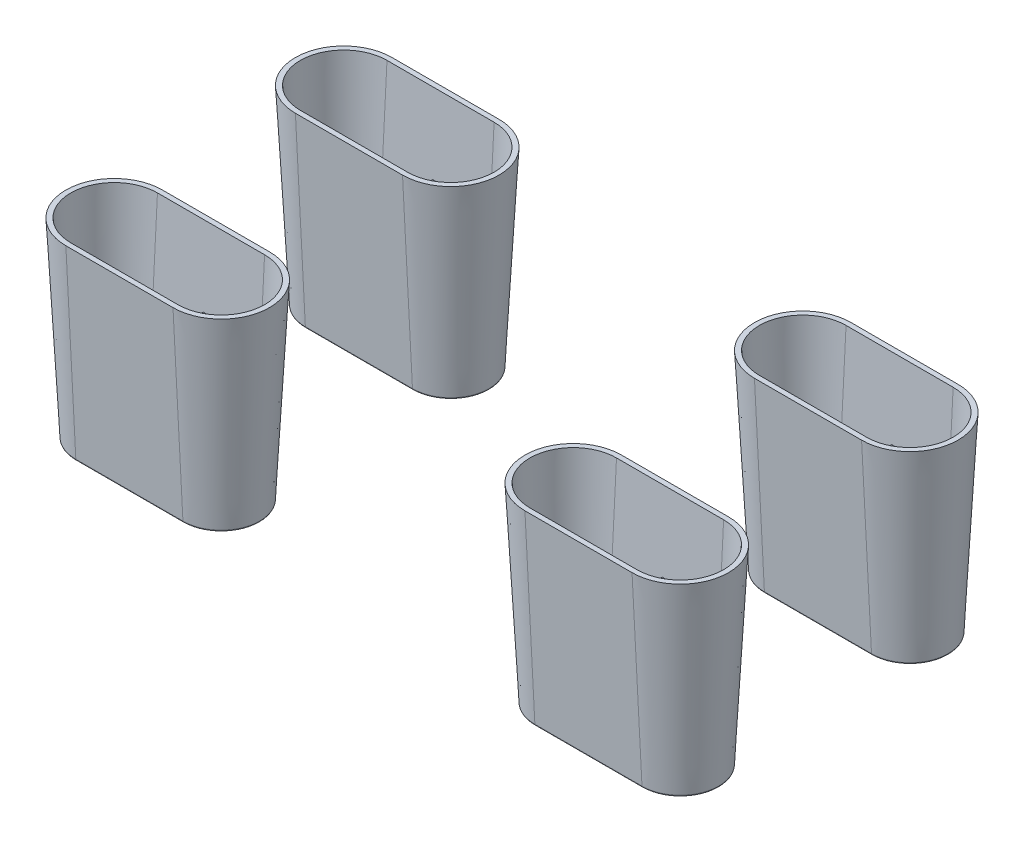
ISO-10303-21;
HEADER;
FILE_DESCRIPTION(('STEP AP214'),'2;1');
FILE_NAME('part.step','',(''),(''),'','','');
FILE_SCHEMA(('AUTOMOTIVE_DESIGN { 1 0 10303 214 1 1 1 1 }'));
ENDSEC;
DATA;
#1=APPLICATION_CONTEXT('core data for automotive mechanical design processes');
#2=APPLICATION_PROTOCOL_DEFINITION('international standard','automotive_design',2000,#1);
#3=PRODUCT_CONTEXT('',#1,'mechanical');
#4=PRODUCT('Part','Part','',(#3));
#5=PRODUCT_RELATED_PRODUCT_CATEGORY('part','',(#4));
#6=PRODUCT_DEFINITION_FORMATION('','',#4);
#7=PRODUCT_DEFINITION_CONTEXT('part definition',#1,'design');
#8=PRODUCT_DEFINITION('design','',#6,#7);
#9=PRODUCT_DEFINITION_SHAPE('','',#8);
#10=(LENGTH_UNIT() NAMED_UNIT(*) SI_UNIT(.MILLI.,.METRE.));
#11=(NAMED_UNIT(*) PLANE_ANGLE_UNIT() SI_UNIT($,.RADIAN.));
#12=(NAMED_UNIT(*) SI_UNIT($,.STERADIAN.) SOLID_ANGLE_UNIT());
#13=UNCERTAINTY_MEASURE_WITH_UNIT(LENGTH_MEASURE(1.E-05),#10,'distance_accuracy_value','');
#14=(GEOMETRIC_REPRESENTATION_CONTEXT(3) GLOBAL_UNCERTAINTY_ASSIGNED_CONTEXT((#13)) GLOBAL_UNIT_ASSIGNED_CONTEXT((#10,
#11,#12)) REPRESENTATION_CONTEXT('',''));
#15=CARTESIAN_POINT('',(0.,0.,0.));
#16=DIRECTION('',(0.,0.,1.));
#17=DIRECTION('',(1.,0.,0.));
#18=AXIS2_PLACEMENT_3D('',#15,#16,#17);
#19=CARTESIAN_POINT('',(53.,-24.9659816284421,-25.6491091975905));
#20=DIRECTION('',(0.,-0.0523359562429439,0.998629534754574));
#21=DIRECTION('',(0.,-0.998629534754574,-0.052335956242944));
#22=AXIS2_PLACEMENT_3D('',#19,#20,#21);
#23=PLANE('',#22);
#24=DIRECTION('',(-1.,0.,0.));
#25=VECTOR('',#24,1.);
#26=CARTESIAN_POINT('',(59.5,-9.98629534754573,-24.8640571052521));
#27=LINE('',#26,#25);
#28=CARTESIAN_POINT('',(59.5,-9.98629534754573,-24.8640571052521));
#29=VERTEX_POINT('',#28);
#30=CARTESIAN_POINT('',(60.5,-9.98629534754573,-24.8640571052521));
#31=VERTEX_POINT('',#30);
#32=EDGE_CURVE('E181',#29,#31,#27,.F.);
#33=ORIENTED_EDGE('',*,*,#32,.F.);
#34=DIRECTION('',(0.,-0.998629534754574,-0.052335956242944));
#35=VECTOR('',#34,1.);
#36=CARTESIAN_POINT('',(59.5,-9.27156836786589,-24.8265998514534));
#37=LINE('',#36,#35);
#38=CARTESIAN_POINT('',(59.5,-24.35,-25.6168269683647));
#39=VERTEX_POINT('',#38);
#40=EDGE_CURVE('E182',#39,#29,#37,.F.);
#41=ORIENTED_EDGE('',*,*,#40,.F.);
#42=DIRECTION('',(-1.,0.,0.));
#43=VECTOR('',#42,1.);
#44=CARTESIAN_POINT('',(53.,-24.35,-25.6168269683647));
#45=LINE('',#44,#43);
#46=CARTESIAN_POINT('',(53.,-24.35,-25.6168269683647));
#47=VERTEX_POINT('',#46);
#48=EDGE_CURVE('E229',#47,#39,#45,.F.);
#49=ORIENTED_EDGE('',*,*,#48,.F.);
#50=DIRECTION('',(0.,-0.998629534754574,-0.052335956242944));
#51=VECTOR('',#50,1.);
#52=CARTESIAN_POINT('',(53.,-24.9659816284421,-25.6491091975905));
#53=LINE('',#52,#51);
#54=CARTESIAN_POINT('',(53.,0.,-24.3406975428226));
#55=VERTEX_POINT('',#54);
#56=EDGE_CURVE('E219',#55,#47,#53,.T.);
#57=ORIENTED_EDGE('',*,*,#56,.F.);
#58=DIRECTION('',(-1.,0.,0.));
#59=VECTOR('',#58,1.);
#60=CARTESIAN_POINT('',(53.,0.,-24.3406975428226));
#61=LINE('',#60,#59);
#62=CARTESIAN_POINT('',(67.,0.,-24.3406975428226));
#63=VERTEX_POINT('',#62);
#64=EDGE_CURVE('E243',#55,#63,#61,.F.);
#65=ORIENTED_EDGE('',*,*,#64,.T.);
#66=DIRECTION('',(0.,0.998629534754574,0.0523359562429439));
#67=VECTOR('',#66,1.);
#68=CARTESIAN_POINT('',(67.,-24.9659816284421,-25.6491091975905));
#69=LINE('',#68,#67);
#70=CARTESIAN_POINT('',(67.,-24.35,-25.6168269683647));
#71=VERTEX_POINT('',#70);
#72=EDGE_CURVE('E223',#63,#71,#69,.F.);
#73=ORIENTED_EDGE('',*,*,#72,.T.);
#74=CARTESIAN_POINT('',(60.5,-24.35,-25.6168269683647));
#75=VERTEX_POINT('',#74);
#76=EDGE_CURVE('E218',#75,#71,#45,.F.);
#77=ORIENTED_EDGE('',*,*,#76,.F.);
#78=DIRECTION('',(0.,0.998629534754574,0.052335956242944));
#79=VECTOR('',#78,1.);
#80=CARTESIAN_POINT('',(60.5,-23.5565871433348,-25.5752459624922));
#81=LINE('',#80,#79);
#82=EDGE_CURVE('E64',#31,#75,#81,.F.);
#83=ORIENTED_EDGE('',*,*,#82,.F.);
#84=EDGE_LOOP('',(#33,#41,#49,#57,#65,#73,#77,#83));
#85=FACE_BOUND('',#84,.T.);
#86=ADVANCED_FACE('F47',(#85),#23,.F.);
#87=CARTESIAN_POINT('',(67.,-24.9659816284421,-34.3508908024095));
#88=DIRECTION('',(0.,-0.0523359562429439,-0.998629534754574));
#89=DIRECTION('',(0.,0.998629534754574,-0.052335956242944));
#90=AXIS2_PLACEMENT_3D('',#87,#88,#89);
#91=PLANE('',#90);
#92=DIRECTION('',(1.,0.,0.));
#93=VECTOR('',#92,1.);
#94=CARTESIAN_POINT('',(67.,-24.35,-34.3831730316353));
#95=LINE('',#94,#93);
#96=CARTESIAN_POINT('',(59.5,-24.35,-34.3831730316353));
#97=VERTEX_POINT('',#96);
#98=CARTESIAN_POINT('',(53.,-24.35,-34.3831730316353));
#99=VERTEX_POINT('',#98);
#100=EDGE_CURVE('E236',#97,#99,#95,.F.);
#101=ORIENTED_EDGE('',*,*,#100,.F.);
#102=DIRECTION('',(0.,-0.998629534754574,0.052335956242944));
#103=VECTOR('',#102,1.);
#104=CARTESIAN_POINT('',(59.5,-9.98629534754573,-35.1359428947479));
#105=LINE('',#104,#103);
#106=CARTESIAN_POINT('',(59.5,-9.98629534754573,-35.1359428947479));
#107=VERTEX_POINT('',#106);
#108=EDGE_CURVE('E195',#107,#97,#105,.T.);
#109=ORIENTED_EDGE('',*,*,#108,.F.);
#110=DIRECTION('',(-1.,0.,0.));
#111=VECTOR('',#110,1.);
#112=CARTESIAN_POINT('',(59.5,-9.98629534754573,-35.1359428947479));
#113=LINE('',#112,#111);
#114=CARTESIAN_POINT('',(60.5,-9.98629534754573,-35.1359428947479));
#115=VERTEX_POINT('',#114);
#116=EDGE_CURVE('E178',#115,#107,#113,.T.);
#117=ORIENTED_EDGE('',*,*,#116,.F.);
#118=DIRECTION('',(0.,0.998629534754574,-0.052335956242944));
#119=VECTOR('',#118,1.);
#120=CARTESIAN_POINT('',(60.5,-24.35,-34.3831730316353));
#121=LINE('',#120,#119);
#122=CARTESIAN_POINT('',(60.5,-24.35,-34.3831730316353));
#123=VERTEX_POINT('',#122);
#124=EDGE_CURVE('E186',#123,#115,#121,.T.);
#125=ORIENTED_EDGE('',*,*,#124,.F.);
#126=CARTESIAN_POINT('',(67.,-24.35,-34.3831730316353));
#127=VERTEX_POINT('',#126);
#128=EDGE_CURVE('E239',#127,#123,#95,.F.);
#129=ORIENTED_EDGE('',*,*,#128,.F.);
#130=DIRECTION('',(0.,0.998629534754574,-0.052335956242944));
#131=VECTOR('',#130,1.);
#132=CARTESIAN_POINT('',(67.,-24.9659816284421,-34.3508908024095));
#133=LINE('',#132,#131);
#134=CARTESIAN_POINT('',(67.,0.,-35.6593024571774));
#135=VERTEX_POINT('',#134);
#136=EDGE_CURVE('E227',#135,#127,#133,.F.);
#137=ORIENTED_EDGE('',*,*,#136,.F.);
#138=DIRECTION('',(1.,0.,0.));
#139=VECTOR('',#138,1.);
#140=CARTESIAN_POINT('',(67.,0.,-35.6593024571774));
#141=LINE('',#140,#139);
#142=CARTESIAN_POINT('',(53.,0.,-35.6593024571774));
#143=VERTEX_POINT('',#142);
#144=EDGE_CURVE('E228',#135,#143,#141,.F.);
#145=ORIENTED_EDGE('',*,*,#144,.T.);
#146=DIRECTION('',(0.,0.998629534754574,-0.0523359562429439));
#147=VECTOR('',#146,1.);
#148=CARTESIAN_POINT('',(53.,-24.9659816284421,-34.3508908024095));
#149=LINE('',#148,#147);
#150=EDGE_CURVE('E224',#143,#99,#149,.F.);
#151=ORIENTED_EDGE('',*,*,#150,.T.);
#152=EDGE_LOOP('',(#101,#109,#117,#125,#129,#137,#145,#151));
#153=FACE_BOUND('',#152,.T.);
#154=ADVANCED_FACE('F194',(#153),#91,.F.);
#155=CARTESIAN_POINT('',(53.,-24.35,-30.));
#156=DIRECTION('',(0.,1.,0.));
#157=DIRECTION('',(0.,0.,1.));
#158=AXIS2_PLACEMENT_3D('',#155,#156,#157);
#159=PLANE('',#158);
#160=ORIENTED_EDGE('',*,*,#48,.T.);
#161=DIRECTION('',(0.,0.,-1.));
#162=VECTOR('',#161,1.);
#163=CARTESIAN_POINT('',(59.5,-24.35,-10.4360267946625));
#164=LINE('',#163,#162);
#165=EDGE_CURVE('E201',#39,#97,#164,.T.);
#166=ORIENTED_EDGE('',*,*,#165,.T.);
#167=ORIENTED_EDGE('',*,*,#100,.T.);
#168=CARTESIAN_POINT('',(53.,-24.35,-30.));
#169=DIRECTION('',(0.,1.,0.));
#170=DIRECTION('',(0.,0.,1.));
#171=AXIS2_PLACEMENT_3D('',#168,#169,#170);
#172=CIRCLE('',#171,4.38317303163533);
#173=EDGE_CURVE('E215',#99,#47,#172,.T.);
#174=ORIENTED_EDGE('',*,*,#173,.T.);
#175=EDGE_LOOP('',(#160,#166,#167,#174));
#176=FACE_BOUND('',#175,.T.);
#177=ADVANCED_FACE('F351',(#176),#159,.T.);
#178=ORIENTED_EDGE('',*,*,#128,.T.);
#179=DIRECTION('',(0.,0.,-1.));
#180=VECTOR('',#179,1.);
#181=CARTESIAN_POINT('',(60.5,-24.35,-10.4360267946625));
#182=LINE('',#181,#180);
#183=EDGE_CURVE('E188',#75,#123,#182,.T.);
#184=ORIENTED_EDGE('',*,*,#183,.F.);
#185=ORIENTED_EDGE('',*,*,#76,.T.);
#186=CARTESIAN_POINT('',(67.,-24.35,-30.));
#187=DIRECTION('',(0.,1.,0.));
#188=DIRECTION('',(0.,0.,1.));
#189=AXIS2_PLACEMENT_3D('',#186,#187,#188);
#190=CIRCLE('',#189,4.38317303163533);
#191=EDGE_CURVE('E232',#71,#127,#190,.T.);
#192=ORIENTED_EDGE('',*,*,#191,.T.);
#193=EDGE_LOOP('',(#178,#184,#185,#192));
#194=FACE_BOUND('',#193,.T.);
#195=ADVANCED_FACE('F356',(#194),#159,.T.);
#196=CARTESIAN_POINT('',(53.,-25.,-30.));
#197=DIRECTION('',(0.,1.,0.));
#198=DIRECTION('',(0.,0.,1.));
#199=AXIS2_PLACEMENT_3D('',#196,#197,#198);
#200=CONICAL_SURFACE('',#199,5.,0.05235987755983);
#201=DIRECTION('',(0.,0.998629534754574,-0.0523359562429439));
#202=VECTOR('',#201,1.);
#203=CARTESIAN_POINT('',(53.,-25.,-35.));
#204=LINE('',#203,#202);
#205=CARTESIAN_POINT('',(53.,0.,-36.310194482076));
#206=VERTEX_POINT('',#205);
#207=CARTESIAN_POINT('',(53.,-24.8104671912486,-35.0099329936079));
#208=VERTEX_POINT('',#207);
#209=EDGE_CURVE('E257',#206,#208,#204,.F.);
#210=ORIENTED_EDGE('',*,*,#209,.T.);
#211=CARTESIAN_POINT('',(53.,-24.8104671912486,-30.));
#212=DIRECTION('',(0.,-1.,0.));
#213=DIRECTION('',(0.,0.,-1.));
#214=AXIS2_PLACEMENT_3D('',#211,#212,#213);
#215=CIRCLE('',#214,5.00993299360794);
#216=CARTESIAN_POINT('',(53.,-24.8104671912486,-24.9900670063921));
#217=VERTEX_POINT('',#216);
#218=EDGE_CURVE('E13',#208,#217,#215,.F.);
#219=ORIENTED_EDGE('',*,*,#218,.T.);
#220=DIRECTION('',(0.,0.998629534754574,0.0523359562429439));
#221=VECTOR('',#220,1.);
#222=CARTESIAN_POINT('',(53.,-25.,-25.));
#223=LINE('',#222,#221);
#224=CARTESIAN_POINT('',(53.,0.,-23.689805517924));
#225=VERTEX_POINT('',#224);
#226=EDGE_CURVE('E258',#225,#217,#223,.F.);
#227=ORIENTED_EDGE('',*,*,#226,.F.);
#228=CARTESIAN_POINT('',(53.,0.,-30.));
#229=DIRECTION('',(0.,1.,0.));
#230=DIRECTION('',(0.,0.,1.));
#231=AXIS2_PLACEMENT_3D('',#228,#229,#230);
#232=CIRCLE('',#231,6.31019448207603);
#233=EDGE_CURVE('E222',#206,#225,#232,.T.);
#234=ORIENTED_EDGE('',*,*,#233,.F.);
#235=EDGE_LOOP('',(#210,#219,#227,#234));
#236=FACE_BOUND('',#235,.T.);
#237=ADVANCED_FACE('F366',(#236),#200,.T.);
#238=CARTESIAN_POINT('',(53.,-25.,-25.));
#239=DIRECTION('',(0.,-0.0523359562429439,0.998629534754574));
#240=DIRECTION('',(0.,-0.998629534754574,-0.052335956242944));
#241=AXIS2_PLACEMENT_3D('',#238,#239,#240);
#242=PLANE('',#241);
#243=ORIENTED_EDGE('',*,*,#226,.T.);
#244=DIRECTION('',(1.,0.,0.));
#245=VECTOR('',#244,1.);
#246=CARTESIAN_POINT('',(53.,-24.8104671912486,-24.9900670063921));
#247=LINE('',#246,#245);
#248=CARTESIAN_POINT('',(67.,-24.8104671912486,-24.9900670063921));
#249=VERTEX_POINT('',#248);
#250=EDGE_CURVE('E261',#217,#249,#247,.T.);
#251=ORIENTED_EDGE('',*,*,#250,.T.);
#252=DIRECTION('',(0.,0.998629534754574,0.0523359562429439));
#253=VECTOR('',#252,1.);
#254=CARTESIAN_POINT('',(67.,-25.,-25.));
#255=LINE('',#254,#253);
#256=CARTESIAN_POINT('',(67.,0.,-23.689805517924));
#257=VERTEX_POINT('',#256);
#258=EDGE_CURVE('E262',#257,#249,#255,.F.);
#259=ORIENTED_EDGE('',*,*,#258,.F.);
#260=DIRECTION('',(-1.,0.,0.));
#261=VECTOR('',#260,1.);
#262=CARTESIAN_POINT('',(53.,0.,-23.689805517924));
#263=LINE('',#262,#261);
#264=EDGE_CURVE('E251',#225,#257,#263,.F.);
#265=ORIENTED_EDGE('',*,*,#264,.F.);
#266=EDGE_LOOP('',(#243,#251,#259,#265));
#267=FACE_BOUND('',#266,.T.);
#268=ADVANCED_FACE('F369',(#267),#242,.T.);
#269=CARTESIAN_POINT('',(67.,-25.,-30.));
#270=DIRECTION('',(0.,1.,0.));
#271=DIRECTION('',(0.,0.,-1.));
#272=AXIS2_PLACEMENT_3D('',#269,#270,#271);
#273=CONICAL_SURFACE('',#272,5.,0.05235987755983);
#274=ORIENTED_EDGE('',*,*,#258,.T.);
#275=CARTESIAN_POINT('',(67.,-24.8104671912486,-30.));
#276=DIRECTION('',(0.,-1.,0.));
#277=DIRECTION('',(0.,0.,-1.));
#278=AXIS2_PLACEMENT_3D('',#275,#276,#277);
#279=CIRCLE('',#278,5.00993299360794);
#280=CARTESIAN_POINT('',(67.,-24.8104671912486,-35.0099329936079));
#281=VERTEX_POINT('',#280);
#282=EDGE_CURVE('E288',#249,#281,#279,.F.);
#283=ORIENTED_EDGE('',*,*,#282,.T.);
#284=DIRECTION('',(0.,0.998629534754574,-0.0523359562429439));
#285=VECTOR('',#284,1.);
#286=CARTESIAN_POINT('',(67.,-25.,-35.));
#287=LINE('',#286,#285);
#288=CARTESIAN_POINT('',(67.,0.,-36.310194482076));
#289=VERTEX_POINT('',#288);
#290=EDGE_CURVE('E264',#289,#281,#287,.F.);
#291=ORIENTED_EDGE('',*,*,#290,.F.);
#292=CARTESIAN_POINT('',(67.,0.,-30.));
#293=DIRECTION('',(0.,1.,0.));
#294=DIRECTION('',(0.,0.,1.));
#295=AXIS2_PLACEMENT_3D('',#292,#293,#294);
#296=CIRCLE('',#295,6.31019448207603);
#297=EDGE_CURVE('E253',#257,#289,#296,.T.);
#298=ORIENTED_EDGE('',*,*,#297,.F.);
#299=EDGE_LOOP('',(#274,#283,#291,#298));
#300=FACE_BOUND('',#299,.T.);
#301=ADVANCED_FACE('F373',(#300),#273,.T.);
#302=CARTESIAN_POINT('',(67.,-25.,-35.));
#303=DIRECTION('',(0.,-0.0523359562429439,-0.998629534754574));
#304=DIRECTION('',(0.,0.998629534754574,-0.052335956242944));
#305=AXIS2_PLACEMENT_3D('',#302,#303,#304);
#306=PLANE('',#305);
#307=ORIENTED_EDGE('',*,*,#290,.T.);
#308=DIRECTION('',(-1.,0.,0.));
#309=VECTOR('',#308,1.);
#310=CARTESIAN_POINT('',(67.,-24.8104671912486,-35.0099329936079));
#311=LINE('',#310,#309);
#312=EDGE_CURVE('E56',#281,#208,#311,.T.);
#313=ORIENTED_EDGE('',*,*,#312,.T.);
#314=ORIENTED_EDGE('',*,*,#209,.F.);
#315=DIRECTION('',(1.,0.,0.));
#316=VECTOR('',#315,1.);
#317=CARTESIAN_POINT('',(67.,0.,-36.310194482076));
#318=LINE('',#317,#316);
#319=EDGE_CURVE('E255',#289,#206,#318,.F.);
#320=ORIENTED_EDGE('',*,*,#319,.F.);
#321=EDGE_LOOP('',(#307,#313,#314,#320));
#322=FACE_BOUND('',#321,.T.);
#323=ADVANCED_FACE('F361',(#322),#306,.T.);
#324=CARTESIAN_POINT('',(53.,0.,-30.));
#325=DIRECTION('',(0.,1.,0.));
#326=DIRECTION('',(0.,0.,1.));
#327=AXIS2_PLACEMENT_3D('',#324,#325,#326);
#328=PLANE('',#327);
#329=CARTESIAN_POINT('',(53.,0.,-30.));
#330=DIRECTION('',(0.,1.,0.));
#331=DIRECTION('',(0.,0.,1.));
#332=AXIS2_PLACEMENT_3D('',#329,#330,#331);
#333=CIRCLE('',#332,5.65930245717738);
#334=EDGE_CURVE('E241',#143,#55,#333,.T.);
#335=ORIENTED_EDGE('',*,*,#334,.F.);
#336=ORIENTED_EDGE('',*,*,#144,.F.);
#337=CARTESIAN_POINT('',(67.,0.,-30.));
#338=DIRECTION('',(0.,1.,0.));
#339=DIRECTION('',(0.,0.,1.));
#340=AXIS2_PLACEMENT_3D('',#337,#338,#339);
#341=CIRCLE('',#340,5.65930245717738);
#342=EDGE_CURVE('E245',#63,#135,#341,.T.);
#343=ORIENTED_EDGE('',*,*,#342,.F.);
#344=ORIENTED_EDGE('',*,*,#64,.F.);
#345=EDGE_LOOP('',(#335,#336,#343,#344));
#346=FACE_BOUND('',#345,.T.);
#347=ORIENTED_EDGE('',*,*,#233,.T.);
#348=ORIENTED_EDGE('',*,*,#264,.T.);
#349=ORIENTED_EDGE('',*,*,#297,.T.);
#350=ORIENTED_EDGE('',*,*,#319,.T.);
#351=EDGE_LOOP('',(#347,#348,#349,#350));
#352=FACE_BOUND('',#351,.T.);
#353=ADVANCED_FACE('F358',(#346,#352),#328,.T.);
#354=CARTESIAN_POINT('',(53.,-25.,-30.));
#355=DIRECTION('',(0.,1.,0.));
#356=DIRECTION('',(0.,0.,1.));
#357=AXIS2_PLACEMENT_3D('',#354,#355,#356);
#358=PLANE('',#357);
#359=CARTESIAN_POINT('',(67.,-25.,-30.));
#360=DIRECTION('',(0.,1.,0.));
#361=DIRECTION('',(0.,0.,1.));
#362=AXIS2_PLACEMENT_3D('',#359,#360,#361);
#363=CIRCLE('',#362,4.81020708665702);
#364=CARTESIAN_POINT('',(67.,-25.,-34.810207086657));
#365=VERTEX_POINT('',#364);
#366=CARTESIAN_POINT('',(67.,-25.,-25.189792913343));
#367=VERTEX_POINT('',#366);
#368=EDGE_CURVE('E283',#365,#367,#363,.F.);
#369=ORIENTED_EDGE('',*,*,#368,.T.);
#370=DIRECTION('',(-1.,0.,0.));
#371=VECTOR('',#370,1.);
#372=CARTESIAN_POINT('',(53.,-25.,-25.189792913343));
#373=LINE('',#372,#371);
#374=CARTESIAN_POINT('',(53.,-25.,-25.189792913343));
#375=VERTEX_POINT('',#374);
#376=EDGE_CURVE('E285',#367,#375,#373,.T.);
#377=ORIENTED_EDGE('',*,*,#376,.T.);
#378=CARTESIAN_POINT('',(53.,-25.,-30.));
#379=DIRECTION('',(0.,1.,0.));
#380=DIRECTION('',(0.,0.,1.));
#381=AXIS2_PLACEMENT_3D('',#378,#379,#380);
#382=CIRCLE('',#381,4.81020708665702);
#383=CARTESIAN_POINT('',(53.,-25.,-34.810207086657));
#384=VERTEX_POINT('',#383);
#385=EDGE_CURVE('E279',#375,#384,#382,.F.);
#386=ORIENTED_EDGE('',*,*,#385,.T.);
#387=DIRECTION('',(1.,0.,0.));
#388=VECTOR('',#387,1.);
#389=CARTESIAN_POINT('',(53.,-25.,-34.810207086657));
#390=LINE('',#389,#388);
#391=EDGE_CURVE('E281',#384,#365,#390,.T.);
#392=ORIENTED_EDGE('',*,*,#391,.T.);
#393=EDGE_LOOP('',(#369,#377,#386,#392));
#394=FACE_BOUND('',#393,.T.);
#395=DIRECTION('',(-1.,0.,0.));
#396=VECTOR('',#395,1.);
#397=CARTESIAN_POINT('',(53.,-25.,-26.8));
#398=LINE('',#397,#396);
#399=CARTESIAN_POINT('',(53.,-25.,-26.8));
#400=VERTEX_POINT('',#399);
#401=CARTESIAN_POINT('',(67.,-25.,-26.8));
#402=VERTEX_POINT('',#401);
#403=EDGE_CURVE('E274',#400,#402,#398,.F.);
#404=ORIENTED_EDGE('',*,*,#403,.T.);
#405=CARTESIAN_POINT('',(67.,-25.,-30.));
#406=DIRECTION('',(0.,1.,0.));
#407=DIRECTION('',(0.,0.,1.));
#408=AXIS2_PLACEMENT_3D('',#405,#406,#407);
#409=CIRCLE('',#408,3.2);
#410=CARTESIAN_POINT('',(67.,-25.,-33.2));
#411=VERTEX_POINT('',#410);
#412=EDGE_CURVE('E276',#402,#411,#409,.T.);
#413=ORIENTED_EDGE('',*,*,#412,.T.);
#414=DIRECTION('',(1.,0.,0.));
#415=VECTOR('',#414,1.);
#416=CARTESIAN_POINT('',(53.,-25.,-33.2));
#417=LINE('',#416,#415);
#418=CARTESIAN_POINT('',(53.,-25.,-33.2));
#419=VERTEX_POINT('',#418);
#420=EDGE_CURVE('E270',#411,#419,#417,.F.);
#421=ORIENTED_EDGE('',*,*,#420,.T.);
#422=CARTESIAN_POINT('',(53.,-25.,-30.));
#423=DIRECTION('',(0.,1.,0.));
#424=DIRECTION('',(0.,0.,1.));
#425=AXIS2_PLACEMENT_3D('',#422,#423,#424);
#426=CIRCLE('',#425,3.2);
#427=EDGE_CURVE('E272',#419,#400,#426,.T.);
#428=ORIENTED_EDGE('',*,*,#427,.T.);
#429=EDGE_LOOP('',(#404,#413,#421,#428));
#430=FACE_BOUND('',#429,.T.);
#431=ADVANCED_FACE('F320',(#394,#430),#358,.F.);
#432=CARTESIAN_POINT('',(53.,-24.9659816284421,-30.));
#433=DIRECTION('',(0.,1.,0.));
#434=DIRECTION('',(0.,0.,1.));
#435=AXIS2_PLACEMENT_3D('',#432,#433,#434);
#436=CONICAL_SURFACE('',#435,4.35089080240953,0.05235987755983);
#437=ORIENTED_EDGE('',*,*,#173,.F.);
#438=ORIENTED_EDGE('',*,*,#150,.F.);
#439=ORIENTED_EDGE('',*,*,#334,.T.);
#440=ORIENTED_EDGE('',*,*,#56,.T.);
#441=EDGE_LOOP('',(#437,#438,#439,#440));
#442=FACE_BOUND('',#441,.T.);
#443=ADVANCED_FACE('F340',(#442),#436,.F.);
#444=CARTESIAN_POINT('',(67.,-24.9659816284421,-30.));
#445=DIRECTION('',(0.,1.,0.));
#446=DIRECTION('',(0.,0.,-1.));
#447=AXIS2_PLACEMENT_3D('',#444,#445,#446);
#448=CONICAL_SURFACE('',#447,4.35089080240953,0.05235987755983);
#449=ORIENTED_EDGE('',*,*,#191,.F.);
#450=ORIENTED_EDGE('',*,*,#72,.F.);
#451=ORIENTED_EDGE('',*,*,#342,.T.);
#452=ORIENTED_EDGE('',*,*,#136,.T.);
#453=EDGE_LOOP('',(#449,#450,#451,#452));
#454=FACE_BOUND('',#453,.T.);
#455=ADVANCED_FACE('F331',(#454),#448,.F.);
#456=CARTESIAN_POINT('',(53.,-24.8,-30.));
#457=DIRECTION('',(0.,-1.,0.));
#458=DIRECTION('',(0.,0.,-1.));
#459=AXIS2_PLACEMENT_3D('',#456,#457,#458);
#460=PLANE('',#459);
#461=CARTESIAN_POINT('',(53.,-24.8,-30.));
#462=DIRECTION('',(0.,-1.,0.));
#463=DIRECTION('',(0.,0.,-1.));
#464=AXIS2_PLACEMENT_3D('',#461,#462,#463);
#465=CIRCLE('',#464,3.);
#466=CARTESIAN_POINT('',(53.,-24.8,-27.));
#467=VERTEX_POINT('',#466);
#468=CARTESIAN_POINT('',(53.,-24.8,-33.));
#469=VERTEX_POINT('',#468);
#470=EDGE_CURVE('E205',#467,#469,#465,.T.);
#471=ORIENTED_EDGE('',*,*,#470,.T.);
#472=DIRECTION('',(1.,0.,0.));
#473=VECTOR('',#472,1.);
#474=CARTESIAN_POINT('',(53.,-24.8,-33.));
#475=LINE('',#474,#473);
#476=CARTESIAN_POINT('',(67.,-24.8,-33.));
#477=VERTEX_POINT('',#476);
#478=EDGE_CURVE('E207',#469,#477,#475,.T.);
#479=ORIENTED_EDGE('',*,*,#478,.T.);
#480=CARTESIAN_POINT('',(67.,-24.8,-30.));
#481=DIRECTION('',(0.,-1.,0.));
#482=DIRECTION('',(0.,0.,-1.));
#483=AXIS2_PLACEMENT_3D('',#480,#481,#482);
#484=CIRCLE('',#483,3.);
#485=CARTESIAN_POINT('',(67.,-24.8,-27.));
#486=VERTEX_POINT('',#485);
#487=EDGE_CURVE('E210',#477,#486,#484,.T.);
#488=ORIENTED_EDGE('',*,*,#487,.T.);
#489=DIRECTION('',(-1.,0.,0.));
#490=VECTOR('',#489,1.);
#491=CARTESIAN_POINT('',(67.,-24.8,-27.));
#492=LINE('',#491,#490);
#493=EDGE_CURVE('E213',#486,#467,#492,.T.);
#494=ORIENTED_EDGE('',*,*,#493,.T.);
#495=EDGE_LOOP('',(#471,#479,#488,#494));
#496=FACE_BOUND('',#495,.T.);
#497=ADVANCED_FACE('F328',(#496),#460,.T.);
#498=CARTESIAN_POINT('',(67.,-24.8,-34.810207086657));
#499=DIRECTION('',(1.,0.,0.));
#500=DIRECTION('',(0.,0.,-1.));
#501=AXIS2_PLACEMENT_3D('',#498,#499,#500);
#502=CYLINDRICAL_SURFACE('',#501,0.2);
#503=CARTESIAN_POINT('',(67.,-24.8,-34.810207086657));
#504=DIRECTION('',(1.,0.,0.));
#505=DIRECTION('',(0.,0.,-1.));
#506=AXIS2_PLACEMENT_3D('',#503,#504,#505);
#507=CIRCLE('',#506,0.2);
#508=EDGE_CURVE('E295',#365,#281,#507,.T.);
#509=ORIENTED_EDGE('',*,*,#508,.F.);
#510=ORIENTED_EDGE('',*,*,#391,.F.);
#511=CARTESIAN_POINT('',(53.,-24.8,-34.810207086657));
#512=DIRECTION('',(-1.,0.,0.));
#513=DIRECTION('',(0.,0.,1.));
#514=AXIS2_PLACEMENT_3D('',#511,#512,#513);
#515=CIRCLE('',#514,0.2);
#516=EDGE_CURVE('E208',#208,#384,#515,.T.);
#517=ORIENTED_EDGE('',*,*,#516,.F.);
#518=ORIENTED_EDGE('',*,*,#312,.F.);
#519=EDGE_LOOP('',(#509,#510,#517,#518));
#520=FACE_BOUND('',#519,.T.);
#521=ADVANCED_FACE('F330',(#520),#502,.T.);
#522=CARTESIAN_POINT('',(53.,-24.8,-30.));
#523=DIRECTION('',(0.,1.,0.));
#524=DIRECTION('',(0.,0.,1.));
#525=AXIS2_PLACEMENT_3D('',#522,#523,#524);
#526=TOROIDAL_SURFACE('',#525,4.81020708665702,0.2);
#527=ORIENTED_EDGE('',*,*,#516,.T.);
#528=ORIENTED_EDGE('',*,*,#385,.F.);
#529=CARTESIAN_POINT('',(53.,-24.8,-25.189792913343));
#530=DIRECTION('',(1.,0.,0.));
#531=DIRECTION('',(0.,0.,-1.));
#532=AXIS2_PLACEMENT_3D('',#529,#530,#531);
#533=CIRCLE('',#532,0.2);
#534=EDGE_CURVE('E293',#217,#375,#533,.T.);
#535=ORIENTED_EDGE('',*,*,#534,.F.);
#536=ORIENTED_EDGE('',*,*,#218,.F.);
#537=EDGE_LOOP('',(#527,#528,#535,#536));
#538=FACE_BOUND('',#537,.T.);
#539=ADVANCED_FACE('F337',(#538),#526,.T.);
#540=CARTESIAN_POINT('',(67.,-24.8,-30.));
#541=DIRECTION('',(0.,1.,0.));
#542=DIRECTION('',(0.,0.,1.));
#543=AXIS2_PLACEMENT_3D('',#540,#541,#542);
#544=TOROIDAL_SURFACE('',#543,4.81020708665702,0.2);
#545=ORIENTED_EDGE('',*,*,#508,.T.);
#546=ORIENTED_EDGE('',*,*,#282,.F.);
#547=CARTESIAN_POINT('',(67.,-24.8,-25.189792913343));
#548=DIRECTION('',(-1.,0.,0.));
#549=DIRECTION('',(0.,0.,1.));
#550=AXIS2_PLACEMENT_3D('',#547,#548,#549);
#551=CIRCLE('',#550,0.2);
#552=EDGE_CURVE('E291',#367,#249,#551,.T.);
#553=ORIENTED_EDGE('',*,*,#552,.F.);
#554=ORIENTED_EDGE('',*,*,#368,.F.);
#555=EDGE_LOOP('',(#545,#546,#553,#554));
#556=FACE_BOUND('',#555,.T.);
#557=ADVANCED_FACE('F383',(#556),#544,.T.);
#558=CARTESIAN_POINT('',(53.,-24.8,-25.189792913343));
#559=DIRECTION('',(-1.,0.,0.));
#560=DIRECTION('',(0.,0.,1.));
#561=AXIS2_PLACEMENT_3D('',#558,#559,#560);
#562=CYLINDRICAL_SURFACE('',#561,0.2);
#563=ORIENTED_EDGE('',*,*,#534,.T.);
#564=ORIENTED_EDGE('',*,*,#376,.F.);
#565=ORIENTED_EDGE('',*,*,#552,.T.);
#566=ORIENTED_EDGE('',*,*,#250,.F.);
#567=EDGE_LOOP('',(#563,#564,#565,#566));
#568=FACE_BOUND('',#567,.T.);
#569=ADVANCED_FACE('F380',(#568),#562,.T.);
#570=CARTESIAN_POINT('',(53.,-24.8,-30.));
#571=DIRECTION('',(0.,1.,0.));
#572=DIRECTION('',(0.,0.,1.));
#573=AXIS2_PLACEMENT_3D('',#570,#571,#572);
#574=TOROIDAL_SURFACE('',#573,3.2,0.2);
#575=CARTESIAN_POINT('',(53.,-24.8,-26.8));
#576=DIRECTION('',(1.,0.,0.));
#577=DIRECTION('',(0.,0.,-1.));
#578=AXIS2_PLACEMENT_3D('',#575,#576,#577);
#579=CIRCLE('',#578,0.2);
#580=EDGE_CURVE('E303',#400,#467,#579,.T.);
#581=ORIENTED_EDGE('',*,*,#580,.F.);
#582=ORIENTED_EDGE('',*,*,#427,.F.);
#583=CARTESIAN_POINT('',(53.,-24.8,-33.2));
#584=DIRECTION('',(1.,0.,0.));
#585=DIRECTION('',(0.,0.,-1.));
#586=AXIS2_PLACEMENT_3D('',#583,#584,#585);
#587=CIRCLE('',#586,0.2);
#588=EDGE_CURVE('E51',#469,#419,#587,.T.);
#589=ORIENTED_EDGE('',*,*,#588,.F.);
#590=ORIENTED_EDGE('',*,*,#470,.F.);
#591=EDGE_LOOP('',(#581,#582,#589,#590));
#592=FACE_BOUND('',#591,.T.);
#593=ADVANCED_FACE('F49',(#592),#574,.T.);
#594=CARTESIAN_POINT('',(53.,-24.8,-33.2));
#595=DIRECTION('',(1.,0.,0.));
#596=DIRECTION('',(0.,0.,-1.));
#597=AXIS2_PLACEMENT_3D('',#594,#595,#596);
#598=CYLINDRICAL_SURFACE('',#597,0.2);
#599=ORIENTED_EDGE('',*,*,#588,.T.);
#600=ORIENTED_EDGE('',*,*,#420,.F.);
#601=CARTESIAN_POINT('',(67.,-24.8,-33.2));
#602=DIRECTION('',(1.,0.,0.));
#603=DIRECTION('',(0.,0.,-1.));
#604=AXIS2_PLACEMENT_3D('',#601,#602,#603);
#605=CIRCLE('',#604,0.2);
#606=EDGE_CURVE('E302',#477,#411,#605,.T.);
#607=ORIENTED_EDGE('',*,*,#606,.F.);
#608=ORIENTED_EDGE('',*,*,#478,.F.);
#609=EDGE_LOOP('',(#599,#600,#607,#608));
#610=FACE_BOUND('',#609,.T.);
#611=ADVANCED_FACE('F314',(#610),#598,.T.);
#612=CARTESIAN_POINT('',(67.,-24.8,-26.8));
#613=DIRECTION('',(-1.,0.,0.));
#614=DIRECTION('',(0.,0.,1.));
#615=AXIS2_PLACEMENT_3D('',#612,#613,#614);
#616=CYLINDRICAL_SURFACE('',#615,0.2);
#617=ORIENTED_EDGE('',*,*,#580,.T.);
#618=ORIENTED_EDGE('',*,*,#493,.F.);
#619=CARTESIAN_POINT('',(67.,-24.8,-26.8));
#620=DIRECTION('',(1.,0.,0.));
#621=DIRECTION('',(0.,0.,-1.));
#622=AXIS2_PLACEMENT_3D('',#619,#620,#621);
#623=CIRCLE('',#622,0.2);
#624=EDGE_CURVE('E300',#402,#486,#623,.T.);
#625=ORIENTED_EDGE('',*,*,#624,.F.);
#626=ORIENTED_EDGE('',*,*,#403,.F.);
#627=EDGE_LOOP('',(#617,#618,#625,#626));
#628=FACE_BOUND('',#627,.T.);
#629=ADVANCED_FACE('F326',(#628),#616,.T.);
#630=CARTESIAN_POINT('',(67.,-24.8,-30.));
#631=DIRECTION('',(0.,1.,0.));
#632=DIRECTION('',(0.,0.,1.));
#633=AXIS2_PLACEMENT_3D('',#630,#631,#632);
#634=TOROIDAL_SURFACE('',#633,3.2,0.2);
#635=ORIENTED_EDGE('',*,*,#606,.T.);
#636=ORIENTED_EDGE('',*,*,#412,.F.);
#637=ORIENTED_EDGE('',*,*,#624,.T.);
#638=ORIENTED_EDGE('',*,*,#487,.F.);
#639=EDGE_LOOP('',(#635,#636,#637,#638));
#640=FACE_BOUND('',#639,.T.);
#641=ADVANCED_FACE('F324',(#640),#634,.T.);
#642=CARTESIAN_POINT('',(59.5,-9.98629534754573,-11.1887966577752));
#643=DIRECTION('',(1.,0.,0.));
#644=DIRECTION('',(0.,1.,0.));
#645=AXIS2_PLACEMENT_3D('',#642,#643,#644);
#646=PLANE('',#645);
#647=ORIENTED_EDGE('',*,*,#165,.F.);
#648=ORIENTED_EDGE('',*,*,#40,.T.);
#649=DIRECTION('',(0.,0.,-1.));
#650=VECTOR('',#649,1.);
#651=CARTESIAN_POINT('',(59.5,-9.98629534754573,-11.1887966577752));
#652=LINE('',#651,#650);
#653=EDGE_CURVE('E183',#29,#107,#652,.T.);
#654=ORIENTED_EDGE('',*,*,#653,.T.);
#655=ORIENTED_EDGE('',*,*,#108,.T.);
#656=EDGE_LOOP('',(#647,#648,#654,#655));
#657=FACE_BOUND('',#656,.T.);
#658=ADVANCED_FACE('F393',(#657),#646,.F.);
#659=CARTESIAN_POINT('',(59.5,-9.98629534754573,-11.1887966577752));
#660=DIRECTION('',(0.,-1.,0.));
#661=DIRECTION('',(0.,0.,-1.));
#662=AXIS2_PLACEMENT_3D('',#659,#660,#661);
#663=PLANE('',#662);
#664=ORIENTED_EDGE('',*,*,#653,.F.);
#665=ORIENTED_EDGE('',*,*,#32,.T.);
#666=DIRECTION('',(0.,0.,-1.));
#667=VECTOR('',#666,1.);
#668=CARTESIAN_POINT('',(60.5,-9.98629534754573,-11.1887966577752));
#669=LINE('',#668,#667);
#670=EDGE_CURVE('E174',#31,#115,#669,.T.);
#671=ORIENTED_EDGE('',*,*,#670,.T.);
#672=ORIENTED_EDGE('',*,*,#116,.T.);
#673=EDGE_LOOP('',(#664,#665,#671,#672));
#674=FACE_BOUND('',#673,.T.);
#675=ADVANCED_FACE('F176',(#674),#663,.F.);
#676=CARTESIAN_POINT('',(60.5,-24.35,-10.4360267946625));
#677=DIRECTION('',(-1.,0.,0.));
#678=DIRECTION('',(0.,-1.,0.));
#679=AXIS2_PLACEMENT_3D('',#676,#677,#678);
#680=PLANE('',#679);
#681=ORIENTED_EDGE('',*,*,#670,.F.);
#682=ORIENTED_EDGE('',*,*,#82,.T.);
#683=ORIENTED_EDGE('',*,*,#183,.T.);
#684=ORIENTED_EDGE('',*,*,#124,.T.);
#685=EDGE_LOOP('',(#681,#682,#683,#684));
#686=FACE_BOUND('',#685,.T.);
#687=ADVANCED_FACE('F187',(#686),#680,.F.);
#688=CLOSED_SHELL('',(#86,#154,#177,#195,#237,#268,#301,#323,#353,#431,#443,#455,#497,#521,#539,
#557,#569,#593,#611,#629,#641,#658,#675,#687));
#689=MANIFOLD_SOLID_BREP('B2',#688);
#690=CARTESIAN_POINT('',(53.,-24.9659816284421,4.35089080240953));
#691=DIRECTION('',(0.,-0.0523359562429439,0.998629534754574));
#692=DIRECTION('',(0.,-0.998629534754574,-0.052335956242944));
#693=AXIS2_PLACEMENT_3D('',#690,#691,#692);
#694=PLANE('',#693);
#695=DIRECTION('',(-1.,0.,0.));
#696=VECTOR('',#695,1.);
#697=CARTESIAN_POINT('',(59.5,-9.98629534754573,5.13594289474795));
#698=LINE('',#697,#696);
#699=CARTESIAN_POINT('',(59.5,-9.98629534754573,5.13594289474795));
#700=VERTEX_POINT('',#699);
#701=CARTESIAN_POINT('',(60.5,-9.98629534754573,5.13594289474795));
#702=VERTEX_POINT('',#701);
#703=EDGE_CURVE('E726',#700,#702,#698,.F.);
#704=ORIENTED_EDGE('',*,*,#703,.F.);
#705=DIRECTION('',(0.,-0.998629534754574,-0.052335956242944));
#706=VECTOR('',#705,1.);
#707=CARTESIAN_POINT('',(59.5,-9.27156836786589,5.17340014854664));
#708=LINE('',#707,#706);
#709=CARTESIAN_POINT('',(59.5,-24.35,4.38317303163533));
#710=VERTEX_POINT('',#709);
#711=EDGE_CURVE('E727',#710,#700,#708,.F.);
#712=ORIENTED_EDGE('',*,*,#711,.F.);
#713=DIRECTION('',(-1.,0.,0.));
#714=VECTOR('',#713,1.);
#715=CARTESIAN_POINT('',(53.,-24.35,4.38317303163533));
#716=LINE('',#715,#714);
#717=CARTESIAN_POINT('',(53.,-24.35,4.38317303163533));
#718=VERTEX_POINT('',#717);
#719=EDGE_CURVE('E774',#718,#710,#716,.F.);
#720=ORIENTED_EDGE('',*,*,#719,.F.);
#721=DIRECTION('',(0.,-0.998629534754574,-0.052335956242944));
#722=VECTOR('',#721,1.);
#723=CARTESIAN_POINT('',(53.,-24.9659816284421,4.35089080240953));
#724=LINE('',#723,#722);
#725=CARTESIAN_POINT('',(53.,0.,5.65930245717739));
#726=VERTEX_POINT('',#725);
#727=EDGE_CURVE('E764',#726,#718,#724,.T.);
#728=ORIENTED_EDGE('',*,*,#727,.F.);
#729=DIRECTION('',(-1.,0.,0.));
#730=VECTOR('',#729,1.);
#731=CARTESIAN_POINT('',(53.,0.,5.65930245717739));
#732=LINE('',#731,#730);
#733=CARTESIAN_POINT('',(67.,0.,5.65930245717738));
#734=VERTEX_POINT('',#733);
#735=EDGE_CURVE('E788',#726,#734,#732,.F.);
#736=ORIENTED_EDGE('',*,*,#735,.T.);
#737=DIRECTION('',(0.,0.998629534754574,0.0523359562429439));
#738=VECTOR('',#737,1.);
#739=CARTESIAN_POINT('',(67.,-24.9659816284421,4.35089080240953));
#740=LINE('',#739,#738);
#741=CARTESIAN_POINT('',(67.,-24.35,4.38317303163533));
#742=VERTEX_POINT('',#741);
#743=EDGE_CURVE('E768',#734,#742,#740,.F.);
#744=ORIENTED_EDGE('',*,*,#743,.T.);
#745=CARTESIAN_POINT('',(60.5,-24.35,4.38317303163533));
#746=VERTEX_POINT('',#745);
#747=EDGE_CURVE('E763',#746,#742,#716,.F.);
#748=ORIENTED_EDGE('',*,*,#747,.F.);
#749=DIRECTION('',(0.,0.998629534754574,0.052335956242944));
#750=VECTOR('',#749,1.);
#751=CARTESIAN_POINT('',(60.5,-23.5565871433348,4.42475403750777));
#752=LINE('',#751,#750);
#753=EDGE_CURVE('E609',#702,#746,#752,.F.);
#754=ORIENTED_EDGE('',*,*,#753,.F.);
#755=EDGE_LOOP('',(#704,#712,#720,#728,#736,#744,#748,#754));
#756=FACE_BOUND('',#755,.T.);
#757=ADVANCED_FACE('F592',(#756),#694,.F.);
#758=CARTESIAN_POINT('',(67.,-24.9659816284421,-4.35089080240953));
#759=DIRECTION('',(0.,-0.0523359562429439,-0.998629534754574));
#760=DIRECTION('',(0.,0.998629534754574,-0.052335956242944));
#761=AXIS2_PLACEMENT_3D('',#758,#759,#760);
#762=PLANE('',#761);
#763=DIRECTION('',(1.,0.,0.));
#764=VECTOR('',#763,1.);
#765=CARTESIAN_POINT('',(67.,-24.35,-4.38317303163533));
#766=LINE('',#765,#764);
#767=CARTESIAN_POINT('',(59.5,-24.35,-4.38317303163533));
#768=VERTEX_POINT('',#767);
#769=CARTESIAN_POINT('',(53.,-24.35,-4.38317303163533));
#770=VERTEX_POINT('',#769);
#771=EDGE_CURVE('E781',#768,#770,#766,.F.);
#772=ORIENTED_EDGE('',*,*,#771,.F.);
#773=DIRECTION('',(0.,-0.998629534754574,0.052335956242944));
#774=VECTOR('',#773,1.);
#775=CARTESIAN_POINT('',(59.5,-9.98629534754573,-5.13594289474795));
#776=LINE('',#775,#774);
#777=CARTESIAN_POINT('',(59.5,-9.98629534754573,-5.13594289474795));
#778=VERTEX_POINT('',#777);
#779=EDGE_CURVE('E740',#778,#768,#776,.T.);
#780=ORIENTED_EDGE('',*,*,#779,.F.);
#781=DIRECTION('',(-1.,0.,0.));
#782=VECTOR('',#781,1.);
#783=CARTESIAN_POINT('',(59.5,-9.98629534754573,-5.13594289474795));
#784=LINE('',#783,#782);
#785=CARTESIAN_POINT('',(60.5,-9.98629534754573,-5.13594289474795));
#786=VERTEX_POINT('',#785);
#787=EDGE_CURVE('E723',#786,#778,#784,.T.);
#788=ORIENTED_EDGE('',*,*,#787,.F.);
#789=DIRECTION('',(0.,0.998629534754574,-0.052335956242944));
#790=VECTOR('',#789,1.);
#791=CARTESIAN_POINT('',(60.5,-24.35,-4.38317303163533));
#792=LINE('',#791,#790);
#793=CARTESIAN_POINT('',(60.5,-24.35,-4.38317303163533));
#794=VERTEX_POINT('',#793);
#795=EDGE_CURVE('E731',#794,#786,#792,.T.);
#796=ORIENTED_EDGE('',*,*,#795,.F.);
#797=CARTESIAN_POINT('',(67.,-24.35,-4.38317303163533));
#798=VERTEX_POINT('',#797);
#799=EDGE_CURVE('E784',#798,#794,#766,.F.);
#800=ORIENTED_EDGE('',*,*,#799,.F.);
#801=DIRECTION('',(0.,0.998629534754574,-0.052335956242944));
#802=VECTOR('',#801,1.);
#803=CARTESIAN_POINT('',(67.,-24.9659816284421,-4.35089080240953));
#804=LINE('',#803,#802);
#805=CARTESIAN_POINT('',(67.,0.,-5.65930245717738));
#806=VERTEX_POINT('',#805);
#807=EDGE_CURVE('E772',#806,#798,#804,.F.);
#808=ORIENTED_EDGE('',*,*,#807,.F.);
#809=DIRECTION('',(1.,0.,0.));
#810=VECTOR('',#809,1.);
#811=CARTESIAN_POINT('',(67.,0.,-5.65930245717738));
#812=LINE('',#811,#810);
#813=CARTESIAN_POINT('',(53.,0.,-5.65930245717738));
#814=VERTEX_POINT('',#813);
#815=EDGE_CURVE('E773',#806,#814,#812,.F.);
#816=ORIENTED_EDGE('',*,*,#815,.T.);
#817=DIRECTION('',(0.,0.998629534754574,-0.0523359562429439));
#818=VECTOR('',#817,1.);
#819=CARTESIAN_POINT('',(53.,-24.9659816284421,-4.35089080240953));
#820=LINE('',#819,#818);
#821=EDGE_CURVE('E769',#814,#770,#820,.F.);
#822=ORIENTED_EDGE('',*,*,#821,.T.);
#823=EDGE_LOOP('',(#772,#780,#788,#796,#800,#808,#816,#822));
#824=FACE_BOUND('',#823,.T.);
#825=ADVANCED_FACE('F739',(#824),#762,.F.);
#826=CARTESIAN_POINT('',(53.,-24.35,0.));
#827=DIRECTION('',(0.,1.,0.));
#828=DIRECTION('',(0.,0.,1.));
#829=AXIS2_PLACEMENT_3D('',#826,#827,#828);
#830=PLANE('',#829);
#831=ORIENTED_EDGE('',*,*,#719,.T.);
#832=DIRECTION('',(0.,0.,-1.));
#833=VECTOR('',#832,1.);
#834=CARTESIAN_POINT('',(59.5,-24.35,19.5639732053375));
#835=LINE('',#834,#833);
#836=EDGE_CURVE('E746',#710,#768,#835,.T.);
#837=ORIENTED_EDGE('',*,*,#836,.T.);
#838=ORIENTED_EDGE('',*,*,#771,.T.);
#839=CARTESIAN_POINT('',(53.,-24.35,0.));
#840=DIRECTION('',(0.,1.,0.));
#841=DIRECTION('',(0.,0.,1.));
#842=AXIS2_PLACEMENT_3D('',#839,#840,#841);
#843=CIRCLE('',#842,4.38317303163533);
#844=EDGE_CURVE('E760',#770,#718,#843,.T.);
#845=ORIENTED_EDGE('',*,*,#844,.T.);
#846=EDGE_LOOP('',(#831,#837,#838,#845));
#847=FACE_BOUND('',#846,.T.);
#848=ADVANCED_FACE('F896',(#847),#830,.T.);
#849=ORIENTED_EDGE('',*,*,#799,.T.);
#850=DIRECTION('',(0.,0.,-1.));
#851=VECTOR('',#850,1.);
#852=CARTESIAN_POINT('',(60.5,-24.35,19.5639732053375));
#853=LINE('',#852,#851);
#854=EDGE_CURVE('E733',#746,#794,#853,.T.);
#855=ORIENTED_EDGE('',*,*,#854,.F.);
#856=ORIENTED_EDGE('',*,*,#747,.T.);
#857=CARTESIAN_POINT('',(67.,-24.35,0.));
#858=DIRECTION('',(0.,1.,0.));
#859=DIRECTION('',(0.,0.,1.));
#860=AXIS2_PLACEMENT_3D('',#857,#858,#859);
#861=CIRCLE('',#860,4.38317303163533);
#862=EDGE_CURVE('E777',#742,#798,#861,.T.);
#863=ORIENTED_EDGE('',*,*,#862,.T.);
#864=EDGE_LOOP('',(#849,#855,#856,#863));
#865=FACE_BOUND('',#864,.T.);
#866=ADVANCED_FACE('F901',(#865),#830,.T.);
#867=CARTESIAN_POINT('',(53.,-25.,0.));
#868=DIRECTION('',(0.,1.,0.));
#869=DIRECTION('',(0.,0.,1.));
#870=AXIS2_PLACEMENT_3D('',#867,#868,#869);
#871=CONICAL_SURFACE('',#870,5.,0.05235987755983);
#872=DIRECTION('',(0.,0.998629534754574,-0.0523359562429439));
#873=VECTOR('',#872,1.);
#874=CARTESIAN_POINT('',(53.,-25.,-5.));
#875=LINE('',#874,#873);
#876=CARTESIAN_POINT('',(53.,0.,-6.31019448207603));
#877=VERTEX_POINT('',#876);
#878=CARTESIAN_POINT('',(53.,-24.8104671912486,-5.00993299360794));
#879=VERTEX_POINT('',#878);
#880=EDGE_CURVE('E802',#877,#879,#875,.F.);
#881=ORIENTED_EDGE('',*,*,#880,.T.);
#882=CARTESIAN_POINT('',(53.,-24.8104671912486,0.));
#883=DIRECTION('',(0.,-1.,0.));
#884=DIRECTION('',(0.,0.,-1.));
#885=AXIS2_PLACEMENT_3D('',#882,#883,#884);
#886=CIRCLE('',#885,5.00993299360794);
#887=CARTESIAN_POINT('',(53.,-24.8104671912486,5.00993299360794));
#888=VERTEX_POINT('',#887);
#889=EDGE_CURVE('E45',#879,#888,#886,.F.);
#890=ORIENTED_EDGE('',*,*,#889,.T.);
#891=DIRECTION('',(0.,0.998629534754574,0.0523359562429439));
#892=VECTOR('',#891,1.);
#893=CARTESIAN_POINT('',(53.,-25.,5.));
#894=LINE('',#893,#892);
#895=CARTESIAN_POINT('',(53.,0.,6.31019448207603));
#896=VERTEX_POINT('',#895);
#897=EDGE_CURVE('E803',#896,#888,#894,.F.);
#898=ORIENTED_EDGE('',*,*,#897,.F.);
#899=CARTESIAN_POINT('',(53.,0.,0.));
#900=DIRECTION('',(0.,1.,0.));
#901=DIRECTION('',(0.,0.,1.));
#902=AXIS2_PLACEMENT_3D('',#899,#900,#901);
#903=CIRCLE('',#902,6.31019448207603);
#904=EDGE_CURVE('E767',#877,#896,#903,.T.);
#905=ORIENTED_EDGE('',*,*,#904,.F.);
#906=EDGE_LOOP('',(#881,#890,#898,#905));
#907=FACE_BOUND('',#906,.T.);
#908=ADVANCED_FACE('F911',(#907),#871,.T.);
#909=CARTESIAN_POINT('',(53.,-25.,5.));
#910=DIRECTION('',(0.,-0.0523359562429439,0.998629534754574));
#911=DIRECTION('',(0.,-0.998629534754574,-0.052335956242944));
#912=AXIS2_PLACEMENT_3D('',#909,#910,#911);
#913=PLANE('',#912);
#914=ORIENTED_EDGE('',*,*,#897,.T.);
#915=DIRECTION('',(1.,0.,0.));
#916=VECTOR('',#915,1.);
#917=CARTESIAN_POINT('',(53.,-24.8104671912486,5.00993299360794));
#918=LINE('',#917,#916);
#919=CARTESIAN_POINT('',(67.,-24.8104671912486,5.00993299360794));
#920=VERTEX_POINT('',#919);
#921=EDGE_CURVE('E806',#888,#920,#918,.T.);
#922=ORIENTED_EDGE('',*,*,#921,.T.);
#923=DIRECTION('',(0.,0.998629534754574,0.0523359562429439));
#924=VECTOR('',#923,1.);
#925=CARTESIAN_POINT('',(67.,-25.,5.));
#926=LINE('',#925,#924);
#927=CARTESIAN_POINT('',(67.,0.,6.31019448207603));
#928=VERTEX_POINT('',#927);
#929=EDGE_CURVE('E807',#928,#920,#926,.F.);
#930=ORIENTED_EDGE('',*,*,#929,.F.);
#931=DIRECTION('',(-1.,0.,0.));
#932=VECTOR('',#931,1.);
#933=CARTESIAN_POINT('',(53.,0.,6.31019448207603));
#934=LINE('',#933,#932);
#935=EDGE_CURVE('E796',#896,#928,#934,.F.);
#936=ORIENTED_EDGE('',*,*,#935,.F.);
#937=EDGE_LOOP('',(#914,#922,#930,#936));
#938=FACE_BOUND('',#937,.T.);
#939=ADVANCED_FACE('F914',(#938),#913,.T.);
#940=CARTESIAN_POINT('',(67.,-25.,0.));
#941=DIRECTION('',(0.,1.,0.));
#942=DIRECTION('',(0.,0.,-1.));
#943=AXIS2_PLACEMENT_3D('',#940,#941,#942);
#944=CONICAL_SURFACE('',#943,5.,0.05235987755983);
#945=ORIENTED_EDGE('',*,*,#929,.T.);
#946=CARTESIAN_POINT('',(67.,-24.8104671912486,0.));
#947=DIRECTION('',(0.,-1.,0.));
#948=DIRECTION('',(0.,0.,-1.));
#949=AXIS2_PLACEMENT_3D('',#946,#947,#948);
#950=CIRCLE('',#949,5.00993299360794);
#951=CARTESIAN_POINT('',(67.,-24.8104671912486,-5.00993299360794));
#952=VERTEX_POINT('',#951);
#953=EDGE_CURVE('E833',#920,#952,#950,.F.);
#954=ORIENTED_EDGE('',*,*,#953,.T.);
#955=DIRECTION('',(0.,0.998629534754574,-0.0523359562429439));
#956=VECTOR('',#955,1.);
#957=CARTESIAN_POINT('',(67.,-25.,-5.));
#958=LINE('',#957,#956);
#959=CARTESIAN_POINT('',(67.,0.,-6.31019448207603));
#960=VERTEX_POINT('',#959);
#961=EDGE_CURVE('E809',#960,#952,#958,.F.);
#962=ORIENTED_EDGE('',*,*,#961,.F.);
#963=CARTESIAN_POINT('',(67.,0.,0.));
#964=DIRECTION('',(0.,1.,0.));
#965=DIRECTION('',(0.,0.,1.));
#966=AXIS2_PLACEMENT_3D('',#963,#964,#965);
#967=CIRCLE('',#966,6.31019448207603);
#968=EDGE_CURVE('E798',#928,#960,#967,.T.);
#969=ORIENTED_EDGE('',*,*,#968,.F.);
#970=EDGE_LOOP('',(#945,#954,#962,#969));
#971=FACE_BOUND('',#970,.T.);
#972=ADVANCED_FACE('F918',(#971),#944,.T.);
#973=CARTESIAN_POINT('',(67.,-25.,-5.));
#974=DIRECTION('',(0.,-0.0523359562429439,-0.998629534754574));
#975=DIRECTION('',(0.,0.998629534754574,-0.052335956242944));
#976=AXIS2_PLACEMENT_3D('',#973,#974,#975);
#977=PLANE('',#976);
#978=ORIENTED_EDGE('',*,*,#961,.T.);
#979=DIRECTION('',(-1.,0.,0.));
#980=VECTOR('',#979,1.);
#981=CARTESIAN_POINT('',(67.,-24.8104671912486,-5.00993299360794));
#982=LINE('',#981,#980);
#983=EDGE_CURVE('E601',#952,#879,#982,.T.);
#984=ORIENTED_EDGE('',*,*,#983,.T.);
#985=ORIENTED_EDGE('',*,*,#880,.F.);
#986=DIRECTION('',(1.,0.,0.));
#987=VECTOR('',#986,1.);
#988=CARTESIAN_POINT('',(67.,0.,-6.31019448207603));
#989=LINE('',#988,#987);
#990=EDGE_CURVE('E800',#960,#877,#989,.F.);
#991=ORIENTED_EDGE('',*,*,#990,.F.);
#992=EDGE_LOOP('',(#978,#984,#985,#991));
#993=FACE_BOUND('',#992,.T.);
#994=ADVANCED_FACE('F906',(#993),#977,.T.);
#995=CARTESIAN_POINT('',(53.,0.,0.));
#996=DIRECTION('',(0.,1.,0.));
#997=DIRECTION('',(0.,0.,1.));
#998=AXIS2_PLACEMENT_3D('',#995,#996,#997);
#999=PLANE('',#998);
#1000=CARTESIAN_POINT('',(53.,0.,0.));
#1001=DIRECTION('',(0.,1.,0.));
#1002=DIRECTION('',(0.,0.,1.));
#1003=AXIS2_PLACEMENT_3D('',#1000,#1001,#1002);
#1004=CIRCLE('',#1003,5.65930245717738);
#1005=EDGE_CURVE('E786',#814,#726,#1004,.T.);
#1006=ORIENTED_EDGE('',*,*,#1005,.F.);
#1007=ORIENTED_EDGE('',*,*,#815,.F.);
#1008=CARTESIAN_POINT('',(67.,0.,0.));
#1009=DIRECTION('',(0.,1.,0.));
#1010=DIRECTION('',(0.,0.,1.));
#1011=AXIS2_PLACEMENT_3D('',#1008,#1009,#1010);
#1012=CIRCLE('',#1011,5.65930245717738);
#1013=EDGE_CURVE('E790',#734,#806,#1012,.T.);
#1014=ORIENTED_EDGE('',*,*,#1013,.F.);
#1015=ORIENTED_EDGE('',*,*,#735,.F.);
#1016=EDGE_LOOP('',(#1006,#1007,#1014,#1015));
#1017=FACE_BOUND('',#1016,.T.);
#1018=ORIENTED_EDGE('',*,*,#904,.T.);
#1019=ORIENTED_EDGE('',*,*,#935,.T.);
#1020=ORIENTED_EDGE('',*,*,#968,.T.);
#1021=ORIENTED_EDGE('',*,*,#990,.T.);
#1022=EDGE_LOOP('',(#1018,#1019,#1020,#1021));
#1023=FACE_BOUND('',#1022,.T.);
#1024=ADVANCED_FACE('F903',(#1017,#1023),#999,.T.);
#1025=CARTESIAN_POINT('',(53.,-25.,0.));
#1026=DIRECTION('',(0.,1.,0.));
#1027=DIRECTION('',(0.,0.,1.));
#1028=AXIS2_PLACEMENT_3D('',#1025,#1026,#1027);
#1029=PLANE('',#1028);
#1030=CARTESIAN_POINT('',(67.,-25.,0.));
#1031=DIRECTION('',(0.,1.,0.));
#1032=DIRECTION('',(0.,0.,1.));
#1033=AXIS2_PLACEMENT_3D('',#1030,#1031,#1032);
#1034=CIRCLE('',#1033,4.81020708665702);
#1035=CARTESIAN_POINT('',(67.,-25.,-4.81020708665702));
#1036=VERTEX_POINT('',#1035);
#1037=CARTESIAN_POINT('',(67.,-25.,4.81020708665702));
#1038=VERTEX_POINT('',#1037);
#1039=EDGE_CURVE('E828',#1036,#1038,#1034,.F.);
#1040=ORIENTED_EDGE('',*,*,#1039,.T.);
#1041=DIRECTION('',(-1.,0.,0.));
#1042=VECTOR('',#1041,1.);
#1043=CARTESIAN_POINT('',(53.,-25.,4.81020708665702));
#1044=LINE('',#1043,#1042);
#1045=CARTESIAN_POINT('',(53.,-25.,4.81020708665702));
#1046=VERTEX_POINT('',#1045);
#1047=EDGE_CURVE('E830',#1038,#1046,#1044,.T.);
#1048=ORIENTED_EDGE('',*,*,#1047,.T.);
#1049=CARTESIAN_POINT('',(53.,-25.,0.));
#1050=DIRECTION('',(0.,1.,0.));
#1051=DIRECTION('',(0.,0.,1.));
#1052=AXIS2_PLACEMENT_3D('',#1049,#1050,#1051);
#1053=CIRCLE('',#1052,4.81020708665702);
#1054=CARTESIAN_POINT('',(53.,-25.,-4.81020708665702));
#1055=VERTEX_POINT('',#1054);
#1056=EDGE_CURVE('E824',#1046,#1055,#1053,.F.);
#1057=ORIENTED_EDGE('',*,*,#1056,.T.);
#1058=DIRECTION('',(1.,0.,0.));
#1059=VECTOR('',#1058,1.);
#1060=CARTESIAN_POINT('',(53.,-25.,-4.81020708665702));
#1061=LINE('',#1060,#1059);
#1062=EDGE_CURVE('E826',#1055,#1036,#1061,.T.);
#1063=ORIENTED_EDGE('',*,*,#1062,.T.);
#1064=EDGE_LOOP('',(#1040,#1048,#1057,#1063));
#1065=FACE_BOUND('',#1064,.T.);
#1066=DIRECTION('',(-1.,0.,0.));
#1067=VECTOR('',#1066,1.);
#1068=CARTESIAN_POINT('',(53.,-25.,3.2));
#1069=LINE('',#1068,#1067);
#1070=CARTESIAN_POINT('',(53.,-25.,3.2));
#1071=VERTEX_POINT('',#1070);
#1072=CARTESIAN_POINT('',(67.,-25.,3.2));
#1073=VERTEX_POINT('',#1072);
#1074=EDGE_CURVE('E819',#1071,#1073,#1069,.F.);
#1075=ORIENTED_EDGE('',*,*,#1074,.T.);
#1076=CARTESIAN_POINT('',(67.,-25.,0.));
#1077=DIRECTION('',(0.,1.,0.));
#1078=DIRECTION('',(0.,0.,1.));
#1079=AXIS2_PLACEMENT_3D('',#1076,#1077,#1078);
#1080=CIRCLE('',#1079,3.2);
#1081=CARTESIAN_POINT('',(67.,-25.,-3.2));
#1082=VERTEX_POINT('',#1081);
#1083=EDGE_CURVE('E821',#1073,#1082,#1080,.T.);
#1084=ORIENTED_EDGE('',*,*,#1083,.T.);
#1085=DIRECTION('',(1.,0.,0.));
#1086=VECTOR('',#1085,1.);
#1087=CARTESIAN_POINT('',(53.,-25.,-3.2));
#1088=LINE('',#1087,#1086);
#1089=CARTESIAN_POINT('',(53.,-25.,-3.2));
#1090=VERTEX_POINT('',#1089);
#1091=EDGE_CURVE('E815',#1082,#1090,#1088,.F.);
#1092=ORIENTED_EDGE('',*,*,#1091,.T.);
#1093=CARTESIAN_POINT('',(53.,-25.,0.));
#1094=DIRECTION('',(0.,1.,0.));
#1095=DIRECTION('',(0.,0.,1.));
#1096=AXIS2_PLACEMENT_3D('',#1093,#1094,#1095);
#1097=CIRCLE('',#1096,3.2);
#1098=EDGE_CURVE('E817',#1090,#1071,#1097,.T.);
#1099=ORIENTED_EDGE('',*,*,#1098,.T.);
#1100=EDGE_LOOP('',(#1075,#1084,#1092,#1099));
#1101=FACE_BOUND('',#1100,.T.);
#1102=ADVANCED_FACE('F865',(#1065,#1101),#1029,.F.);
#1103=CARTESIAN_POINT('',(53.,-24.9659816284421,0.));
#1104=DIRECTION('',(0.,1.,0.));
#1105=DIRECTION('',(0.,0.,1.));
#1106=AXIS2_PLACEMENT_3D('',#1103,#1104,#1105);
#1107=CONICAL_SURFACE('',#1106,4.35089080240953,0.05235987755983);
#1108=ORIENTED_EDGE('',*,*,#844,.F.);
#1109=ORIENTED_EDGE('',*,*,#821,.F.);
#1110=ORIENTED_EDGE('',*,*,#1005,.T.);
#1111=ORIENTED_EDGE('',*,*,#727,.T.);
#1112=EDGE_LOOP('',(#1108,#1109,#1110,#1111));
#1113=FACE_BOUND('',#1112,.T.);
#1114=ADVANCED_FACE('F885',(#1113),#1107,.F.);
#1115=CARTESIAN_POINT('',(67.,-24.9659816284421,0.));
#1116=DIRECTION('',(0.,1.,0.));
#1117=DIRECTION('',(0.,0.,-1.));
#1118=AXIS2_PLACEMENT_3D('',#1115,#1116,#1117);
#1119=CONICAL_SURFACE('',#1118,4.35089080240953,0.05235987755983);
#1120=ORIENTED_EDGE('',*,*,#862,.F.);
#1121=ORIENTED_EDGE('',*,*,#743,.F.);
#1122=ORIENTED_EDGE('',*,*,#1013,.T.);
#1123=ORIENTED_EDGE('',*,*,#807,.T.);
#1124=EDGE_LOOP('',(#1120,#1121,#1122,#1123));
#1125=FACE_BOUND('',#1124,.T.);
#1126=ADVANCED_FACE('F876',(#1125),#1119,.F.);
#1127=CARTESIAN_POINT('',(53.,-24.8,0.));
#1128=DIRECTION('',(0.,-1.,0.));
#1129=DIRECTION('',(0.,0.,-1.));
#1130=AXIS2_PLACEMENT_3D('',#1127,#1128,#1129);
#1131=PLANE('',#1130);
#1132=CARTESIAN_POINT('',(53.,-24.8,0.));
#1133=DIRECTION('',(0.,-1.,0.));
#1134=DIRECTION('',(0.,0.,-1.));
#1135=AXIS2_PLACEMENT_3D('',#1132,#1133,#1134);
#1136=CIRCLE('',#1135,3.);
#1137=CARTESIAN_POINT('',(53.,-24.8,3.));
#1138=VERTEX_POINT('',#1137);
#1139=CARTESIAN_POINT('',(53.,-24.8,-3.));
#1140=VERTEX_POINT('',#1139);
#1141=EDGE_CURVE('E750',#1138,#1140,#1136,.T.);
#1142=ORIENTED_EDGE('',*,*,#1141,.T.);
#1143=DIRECTION('',(1.,0.,0.));
#1144=VECTOR('',#1143,1.);
#1145=CARTESIAN_POINT('',(53.,-24.8,-3.));
#1146=LINE('',#1145,#1144);
#1147=CARTESIAN_POINT('',(67.,-24.8,-3.));
#1148=VERTEX_POINT('',#1147);
#1149=EDGE_CURVE('E752',#1140,#1148,#1146,.T.);
#1150=ORIENTED_EDGE('',*,*,#1149,.T.);
#1151=CARTESIAN_POINT('',(67.,-24.8,0.));
#1152=DIRECTION('',(0.,-1.,0.));
#1153=DIRECTION('',(0.,0.,-1.));
#1154=AXIS2_PLACEMENT_3D('',#1151,#1152,#1153);
#1155=CIRCLE('',#1154,3.);
#1156=CARTESIAN_POINT('',(67.,-24.8,3.));
#1157=VERTEX_POINT('',#1156);
#1158=EDGE_CURVE('E755',#1148,#1157,#1155,.T.);
#1159=ORIENTED_EDGE('',*,*,#1158,.T.);
#1160=DIRECTION('',(-1.,0.,0.));
#1161=VECTOR('',#1160,1.);
#1162=CARTESIAN_POINT('',(67.,-24.8,3.));
#1163=LINE('',#1162,#1161);
#1164=EDGE_CURVE('E758',#1157,#1138,#1163,.T.);
#1165=ORIENTED_EDGE('',*,*,#1164,.T.);
#1166=EDGE_LOOP('',(#1142,#1150,#1159,#1165));
#1167=FACE_BOUND('',#1166,.T.);
#1168=ADVANCED_FACE('F873',(#1167),#1131,.T.);
#1169=CARTESIAN_POINT('',(67.,-24.8,-4.81020708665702));
#1170=DIRECTION('',(1.,0.,0.));
#1171=DIRECTION('',(0.,0.,-1.));
#1172=AXIS2_PLACEMENT_3D('',#1169,#1170,#1171);
#1173=CYLINDRICAL_SURFACE('',#1172,0.2);
#1174=CARTESIAN_POINT('',(67.,-24.8,-4.81020708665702));
#1175=DIRECTION('',(1.,0.,0.));
#1176=DIRECTION('',(0.,0.,-1.));
#1177=AXIS2_PLACEMENT_3D('',#1174,#1175,#1176);
#1178=CIRCLE('',#1177,0.2);
#1179=EDGE_CURVE('E840',#1036,#952,#1178,.T.);
#1180=ORIENTED_EDGE('',*,*,#1179,.F.);
#1181=ORIENTED_EDGE('',*,*,#1062,.F.);
#1182=CARTESIAN_POINT('',(53.,-24.8,-4.81020708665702));
#1183=DIRECTION('',(-1.,0.,0.));
#1184=DIRECTION('',(0.,0.,1.));
#1185=AXIS2_PLACEMENT_3D('',#1182,#1183,#1184);
#1186=CIRCLE('',#1185,0.2);
#1187=EDGE_CURVE('E753',#879,#1055,#1186,.T.);
#1188=ORIENTED_EDGE('',*,*,#1187,.F.);
#1189=ORIENTED_EDGE('',*,*,#983,.F.);
#1190=EDGE_LOOP('',(#1180,#1181,#1188,#1189));
#1191=FACE_BOUND('',#1190,.T.);
#1192=ADVANCED_FACE('F875',(#1191),#1173,.T.);
#1193=CARTESIAN_POINT('',(53.,-24.8,0.));
#1194=DIRECTION('',(0.,1.,0.));
#1195=DIRECTION('',(0.,0.,1.));
#1196=AXIS2_PLACEMENT_3D('',#1193,#1194,#1195);
#1197=TOROIDAL_SURFACE('',#1196,4.81020708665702,0.2);
#1198=ORIENTED_EDGE('',*,*,#1187,.T.);
#1199=ORIENTED_EDGE('',*,*,#1056,.F.);
#1200=CARTESIAN_POINT('',(53.,-24.8,4.81020708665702));
#1201=DIRECTION('',(1.,0.,0.));
#1202=DIRECTION('',(0.,0.,-1.));
#1203=AXIS2_PLACEMENT_3D('',#1200,#1201,#1202);
#1204=CIRCLE('',#1203,0.2);
#1205=EDGE_CURVE('E838',#888,#1046,#1204,.T.);
#1206=ORIENTED_EDGE('',*,*,#1205,.F.);
#1207=ORIENTED_EDGE('',*,*,#889,.F.);
#1208=EDGE_LOOP('',(#1198,#1199,#1206,#1207));
#1209=FACE_BOUND('',#1208,.T.);
#1210=ADVANCED_FACE('F882',(#1209),#1197,.T.);
#1211=CARTESIAN_POINT('',(67.,-24.8,0.));
#1212=DIRECTION('',(0.,1.,0.));
#1213=DIRECTION('',(0.,0.,1.));
#1214=AXIS2_PLACEMENT_3D('',#1211,#1212,#1213);
#1215=TOROIDAL_SURFACE('',#1214,4.81020708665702,0.2);
#1216=ORIENTED_EDGE('',*,*,#1179,.T.);
#1217=ORIENTED_EDGE('',*,*,#953,.F.);
#1218=CARTESIAN_POINT('',(67.,-24.8,4.81020708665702));
#1219=DIRECTION('',(-1.,0.,0.));
#1220=DIRECTION('',(0.,0.,1.));
#1221=AXIS2_PLACEMENT_3D('',#1218,#1219,#1220);
#1222=CIRCLE('',#1221,0.2);
#1223=EDGE_CURVE('E836',#1038,#920,#1222,.T.);
#1224=ORIENTED_EDGE('',*,*,#1223,.F.);
#1225=ORIENTED_EDGE('',*,*,#1039,.F.);
#1226=EDGE_LOOP('',(#1216,#1217,#1224,#1225));
#1227=FACE_BOUND('',#1226,.T.);
#1228=ADVANCED_FACE('F928',(#1227),#1215,.T.);
#1229=CARTESIAN_POINT('',(53.,-24.8,4.81020708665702));
#1230=DIRECTION('',(-1.,0.,0.));
#1231=DIRECTION('',(0.,0.,1.));
#1232=AXIS2_PLACEMENT_3D('',#1229,#1230,#1231);
#1233=CYLINDRICAL_SURFACE('',#1232,0.2);
#1234=ORIENTED_EDGE('',*,*,#1205,.T.);
#1235=ORIENTED_EDGE('',*,*,#1047,.F.);
#1236=ORIENTED_EDGE('',*,*,#1223,.T.);
#1237=ORIENTED_EDGE('',*,*,#921,.F.);
#1238=EDGE_LOOP('',(#1234,#1235,#1236,#1237));
#1239=FACE_BOUND('',#1238,.T.);
#1240=ADVANCED_FACE('F925',(#1239),#1233,.T.);
#1241=CARTESIAN_POINT('',(53.,-24.8,0.));
#1242=DIRECTION('',(0.,1.,0.));
#1243=DIRECTION('',(0.,0.,1.));
#1244=AXIS2_PLACEMENT_3D('',#1241,#1242,#1243);
#1245=TOROIDAL_SURFACE('',#1244,3.2,0.2);
#1246=CARTESIAN_POINT('',(53.,-24.8,3.2));
#1247=DIRECTION('',(1.,0.,0.));
#1248=DIRECTION('',(0.,0.,-1.));
#1249=AXIS2_PLACEMENT_3D('',#1246,#1247,#1248);
#1250=CIRCLE('',#1249,0.2);
#1251=EDGE_CURVE('E848',#1071,#1138,#1250,.T.);
#1252=ORIENTED_EDGE('',*,*,#1251,.F.);
#1253=ORIENTED_EDGE('',*,*,#1098,.F.);
#1254=CARTESIAN_POINT('',(53.,-24.8,-3.2));
#1255=DIRECTION('',(1.,0.,0.));
#1256=DIRECTION('',(0.,0.,-1.));
#1257=AXIS2_PLACEMENT_3D('',#1254,#1255,#1256);
#1258=CIRCLE('',#1257,0.2);
#1259=EDGE_CURVE('E596',#1140,#1090,#1258,.T.);
#1260=ORIENTED_EDGE('',*,*,#1259,.F.);
#1261=ORIENTED_EDGE('',*,*,#1141,.F.);
#1262=EDGE_LOOP('',(#1252,#1253,#1260,#1261));
#1263=FACE_BOUND('',#1262,.T.);
#1264=ADVANCED_FACE('F594',(#1263),#1245,.T.);
#1265=CARTESIAN_POINT('',(53.,-24.8,-3.2));
#1266=DIRECTION('',(1.,0.,0.));
#1267=DIRECTION('',(0.,0.,-1.));
#1268=AXIS2_PLACEMENT_3D('',#1265,#1266,#1267);
#1269=CYLINDRICAL_SURFACE('',#1268,0.2);
#1270=ORIENTED_EDGE('',*,*,#1259,.T.);
#1271=ORIENTED_EDGE('',*,*,#1091,.F.);
#1272=CARTESIAN_POINT('',(67.,-24.8,-3.2));
#1273=DIRECTION('',(1.,0.,0.));
#1274=DIRECTION('',(0.,0.,-1.));
#1275=AXIS2_PLACEMENT_3D('',#1272,#1273,#1274);
#1276=CIRCLE('',#1275,0.2);
#1277=EDGE_CURVE('E847',#1148,#1082,#1276,.T.);
#1278=ORIENTED_EDGE('',*,*,#1277,.F.);
#1279=ORIENTED_EDGE('',*,*,#1149,.F.);
#1280=EDGE_LOOP('',(#1270,#1271,#1278,#1279));
#1281=FACE_BOUND('',#1280,.T.);
#1282=ADVANCED_FACE('F859',(#1281),#1269,.T.);
#1283=CARTESIAN_POINT('',(67.,-24.8,3.2));
#1284=DIRECTION('',(-1.,0.,0.));
#1285=DIRECTION('',(0.,0.,1.));
#1286=AXIS2_PLACEMENT_3D('',#1283,#1284,#1285);
#1287=CYLINDRICAL_SURFACE('',#1286,0.2);
#1288=ORIENTED_EDGE('',*,*,#1251,.T.);
#1289=ORIENTED_EDGE('',*,*,#1164,.F.);
#1290=CARTESIAN_POINT('',(67.,-24.8,3.2));
#1291=DIRECTION('',(1.,0.,0.));
#1292=DIRECTION('',(0.,0.,-1.));
#1293=AXIS2_PLACEMENT_3D('',#1290,#1291,#1292);
#1294=CIRCLE('',#1293,0.2);
#1295=EDGE_CURVE('E845',#1073,#1157,#1294,.T.);
#1296=ORIENTED_EDGE('',*,*,#1295,.F.);
#1297=ORIENTED_EDGE('',*,*,#1074,.F.);
#1298=EDGE_LOOP('',(#1288,#1289,#1296,#1297));
#1299=FACE_BOUND('',#1298,.T.);
#1300=ADVANCED_FACE('F871',(#1299),#1287,.T.);
#1301=CARTESIAN_POINT('',(67.,-24.8,0.));
#1302=DIRECTION('',(0.,1.,0.));
#1303=DIRECTION('',(0.,0.,1.));
#1304=AXIS2_PLACEMENT_3D('',#1301,#1302,#1303);
#1305=TOROIDAL_SURFACE('',#1304,3.2,0.2);
#1306=ORIENTED_EDGE('',*,*,#1277,.T.);
#1307=ORIENTED_EDGE('',*,*,#1083,.F.);
#1308=ORIENTED_EDGE('',*,*,#1295,.T.);
#1309=ORIENTED_EDGE('',*,*,#1158,.F.);
#1310=EDGE_LOOP('',(#1306,#1307,#1308,#1309));
#1311=FACE_BOUND('',#1310,.T.);
#1312=ADVANCED_FACE('F869',(#1311),#1305,.T.);
#1313=CARTESIAN_POINT('',(59.5,-9.98629534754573,18.8112033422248));
#1314=DIRECTION('',(1.,0.,0.));
#1315=DIRECTION('',(0.,1.,0.));
#1316=AXIS2_PLACEMENT_3D('',#1313,#1314,#1315);
#1317=PLANE('',#1316);
#1318=ORIENTED_EDGE('',*,*,#836,.F.);
#1319=ORIENTED_EDGE('',*,*,#711,.T.);
#1320=DIRECTION('',(0.,0.,-1.));
#1321=VECTOR('',#1320,1.);
#1322=CARTESIAN_POINT('',(59.5,-9.98629534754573,18.8112033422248));
#1323=LINE('',#1322,#1321);
#1324=EDGE_CURVE('E728',#700,#778,#1323,.T.);
#1325=ORIENTED_EDGE('',*,*,#1324,.T.);
#1326=ORIENTED_EDGE('',*,*,#779,.T.);
#1327=EDGE_LOOP('',(#1318,#1319,#1325,#1326));
#1328=FACE_BOUND('',#1327,.T.);
#1329=ADVANCED_FACE('F938',(#1328),#1317,.F.);
#1330=CARTESIAN_POINT('',(59.5,-9.98629534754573,18.8112033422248));
#1331=DIRECTION('',(0.,-1.,0.));
#1332=DIRECTION('',(0.,0.,-1.));
#1333=AXIS2_PLACEMENT_3D('',#1330,#1331,#1332);
#1334=PLANE('',#1333);
#1335=ORIENTED_EDGE('',*,*,#1324,.F.);
#1336=ORIENTED_EDGE('',*,*,#703,.T.);
#1337=DIRECTION('',(0.,0.,-1.));
#1338=VECTOR('',#1337,1.);
#1339=CARTESIAN_POINT('',(60.5,-9.98629534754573,18.8112033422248));
#1340=LINE('',#1339,#1338);
#1341=EDGE_CURVE('E719',#702,#786,#1340,.T.);
#1342=ORIENTED_EDGE('',*,*,#1341,.T.);
#1343=ORIENTED_EDGE('',*,*,#787,.T.);
#1344=EDGE_LOOP('',(#1335,#1336,#1342,#1343));
#1345=FACE_BOUND('',#1344,.T.);
#1346=ADVANCED_FACE('F721',(#1345),#1334,.F.);
#1347=CARTESIAN_POINT('',(60.5,-24.35,19.5639732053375));
#1348=DIRECTION('',(-1.,0.,0.));
#1349=DIRECTION('',(0.,-1.,0.));
#1350=AXIS2_PLACEMENT_3D('',#1347,#1348,#1349);
#1351=PLANE('',#1350);
#1352=ORIENTED_EDGE('',*,*,#1341,.F.);
#1353=ORIENTED_EDGE('',*,*,#753,.T.);
#1354=ORIENTED_EDGE('',*,*,#854,.T.);
#1355=ORIENTED_EDGE('',*,*,#795,.T.);
#1356=EDGE_LOOP('',(#1352,#1353,#1354,#1355));
#1357=FACE_BOUND('',#1356,.T.);
#1358=ADVANCED_FACE('F732',(#1357),#1351,.F.);
#1359=CLOSED_SHELL('',(#757,#825,#848,#866,#908,#939,#972,#994,#1024,#1102,#1114,#1126,#1168,
#1192,#1210,#1228,#1240,#1264,#1282,#1300,#1312,#1329,#1346,#1358));
#1360=MANIFOLD_SOLID_BREP('B7',#1359);
#1361=CARTESIAN_POINT('',(-7.,-24.9659816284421,-25.6491091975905));
#1362=DIRECTION('',(0.,-0.0523359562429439,0.998629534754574));
#1363=DIRECTION('',(0.,-0.998629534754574,-0.052335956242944));
#1364=AXIS2_PLACEMENT_3D('',#1361,#1362,#1363);
#1365=PLANE('',#1364);
#1366=DIRECTION('',(-1.,0.,0.));
#1367=VECTOR('',#1366,1.);
#1368=CARTESIAN_POINT('',(-0.500000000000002,-9.98629534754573,-24.8640571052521));
#1369=LINE('',#1368,#1367);
#1370=CARTESIAN_POINT('',(-0.500000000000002,-9.98629534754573,-24.8640571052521));
#1371=VERTEX_POINT('',#1370);
#1372=CARTESIAN_POINT('',(0.499999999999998,-9.98629534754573,-24.8640571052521));
#1373=VERTEX_POINT('',#1372);
#1374=EDGE_CURVE('E1270',#1371,#1373,#1369,.F.);
#1375=ORIENTED_EDGE('',*,*,#1374,.F.);
#1376=DIRECTION('',(0.,-0.998629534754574,-0.052335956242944));
#1377=VECTOR('',#1376,1.);
#1378=CARTESIAN_POINT('',(-0.500000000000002,-9.27156836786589,-24.8265998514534));
#1379=LINE('',#1378,#1377);
#1380=CARTESIAN_POINT('',(-0.500000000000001,-24.35,-25.6168269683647));
#1381=VERTEX_POINT('',#1380);
#1382=EDGE_CURVE('E1271',#1381,#1371,#1379,.F.);
#1383=ORIENTED_EDGE('',*,*,#1382,.F.);
#1384=DIRECTION('',(-1.,0.,0.));
#1385=VECTOR('',#1384,1.);
#1386=CARTESIAN_POINT('',(-7.,-24.35,-25.6168269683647));
#1387=LINE('',#1386,#1385);
#1388=CARTESIAN_POINT('',(-7.,-24.35,-25.6168269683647));
#1389=VERTEX_POINT('',#1388);
#1390=EDGE_CURVE('E1318',#1389,#1381,#1387,.F.);
#1391=ORIENTED_EDGE('',*,*,#1390,.F.);
#1392=DIRECTION('',(0.,-0.998629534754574,-0.052335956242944));
#1393=VECTOR('',#1392,1.);
#1394=CARTESIAN_POINT('',(-7.,-24.9659816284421,-25.6491091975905));
#1395=LINE('',#1394,#1393);
#1396=CARTESIAN_POINT('',(-7.,0.,-24.3406975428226));
#1397=VERTEX_POINT('',#1396);
#1398=EDGE_CURVE('E1308',#1397,#1389,#1395,.T.);
#1399=ORIENTED_EDGE('',*,*,#1398,.F.);
#1400=DIRECTION('',(-1.,0.,0.));
#1401=VECTOR('',#1400,1.);
#1402=CARTESIAN_POINT('',(-7.,0.,-24.3406975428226));
#1403=LINE('',#1402,#1401);
#1404=CARTESIAN_POINT('',(7.,0.,-24.3406975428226));
#1405=VERTEX_POINT('',#1404);
#1406=EDGE_CURVE('E1332',#1397,#1405,#1403,.F.);
#1407=ORIENTED_EDGE('',*,*,#1406,.T.);
#1408=DIRECTION('',(0.,0.998629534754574,0.0523359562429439));
#1409=VECTOR('',#1408,1.);
#1410=CARTESIAN_POINT('',(7.,-24.9659816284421,-25.6491091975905));
#1411=LINE('',#1410,#1409);
#1412=CARTESIAN_POINT('',(7.,-24.35,-25.6168269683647));
#1413=VERTEX_POINT('',#1412);
#1414=EDGE_CURVE('E1312',#1405,#1413,#1411,.F.);
#1415=ORIENTED_EDGE('',*,*,#1414,.T.);
#1416=CARTESIAN_POINT('',(0.500000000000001,-24.35,-25.6168269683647));
#1417=VERTEX_POINT('',#1416);
#1418=EDGE_CURVE('E1307',#1417,#1413,#1387,.F.);
#1419=ORIENTED_EDGE('',*,*,#1418,.F.);
#1420=DIRECTION('',(0.,0.998629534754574,0.052335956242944));
#1421=VECTOR('',#1420,1.);
#1422=CARTESIAN_POINT('',(0.500000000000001,-23.5565871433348,-25.5752459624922));
#1423=LINE('',#1422,#1421);
#1424=EDGE_CURVE('E1153',#1373,#1417,#1423,.F.);
#1425=ORIENTED_EDGE('',*,*,#1424,.F.);
#1426=EDGE_LOOP('',(#1375,#1383,#1391,#1399,#1407,#1415,#1419,#1425));
#1427=FACE_BOUND('',#1426,.T.);
#1428=ADVANCED_FACE('F1136',(#1427),#1365,.F.);
#1429=CARTESIAN_POINT('',(7.,-24.9659816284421,-34.3508908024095));
#1430=DIRECTION('',(0.,-0.0523359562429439,-0.998629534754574));
#1431=DIRECTION('',(0.,0.998629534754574,-0.052335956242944));
#1432=AXIS2_PLACEMENT_3D('',#1429,#1430,#1431);
#1433=PLANE('',#1432);
#1434=DIRECTION('',(1.,0.,0.));
#1435=VECTOR('',#1434,1.);
#1436=CARTESIAN_POINT('',(7.,-24.35,-34.3831730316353));
#1437=LINE('',#1436,#1435);
#1438=CARTESIAN_POINT('',(-0.500000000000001,-24.35,-34.3831730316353));
#1439=VERTEX_POINT('',#1438);
#1440=CARTESIAN_POINT('',(-7.,-24.35,-34.3831730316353));
#1441=VERTEX_POINT('',#1440);
#1442=EDGE_CURVE('E1325',#1439,#1441,#1437,.F.);
#1443=ORIENTED_EDGE('',*,*,#1442,.F.);
#1444=DIRECTION('',(0.,-0.998629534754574,0.052335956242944));
#1445=VECTOR('',#1444,1.);
#1446=CARTESIAN_POINT('',(-0.500000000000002,-9.98629534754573,-35.1359428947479));
#1447=LINE('',#1446,#1445);
#1448=CARTESIAN_POINT('',(-0.500000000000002,-9.98629534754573,-35.1359428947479));
#1449=VERTEX_POINT('',#1448);
#1450=EDGE_CURVE('E1284',#1449,#1439,#1447,.T.);
#1451=ORIENTED_EDGE('',*,*,#1450,.F.);
#1452=DIRECTION('',(-1.,0.,0.));
#1453=VECTOR('',#1452,1.);
#1454=CARTESIAN_POINT('',(-0.500000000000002,-9.98629534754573,-35.1359428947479));
#1455=LINE('',#1454,#1453);
#1456=CARTESIAN_POINT('',(0.499999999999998,-9.98629534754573,-35.1359428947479));
#1457=VERTEX_POINT('',#1456);
#1458=EDGE_CURVE('E1267',#1457,#1449,#1455,.T.);
#1459=ORIENTED_EDGE('',*,*,#1458,.F.);
#1460=DIRECTION('',(0.,0.998629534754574,-0.052335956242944));
#1461=VECTOR('',#1460,1.);
#1462=CARTESIAN_POINT('',(0.500000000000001,-24.35,-34.3831730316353));
#1463=LINE('',#1462,#1461);
#1464=CARTESIAN_POINT('',(0.500000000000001,-24.35,-34.3831730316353));
#1465=VERTEX_POINT('',#1464);
#1466=EDGE_CURVE('E1275',#1465,#1457,#1463,.T.);
#1467=ORIENTED_EDGE('',*,*,#1466,.F.);
#1468=CARTESIAN_POINT('',(7.,-24.35,-34.3831730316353));
#1469=VERTEX_POINT('',#1468);
#1470=EDGE_CURVE('E1328',#1469,#1465,#1437,.F.);
#1471=ORIENTED_EDGE('',*,*,#1470,.F.);
#1472=DIRECTION('',(0.,0.998629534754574,-0.052335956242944));
#1473=VECTOR('',#1472,1.);
#1474=CARTESIAN_POINT('',(7.,-24.9659816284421,-34.3508908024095));
#1475=LINE('',#1474,#1473);
#1476=CARTESIAN_POINT('',(7.,0.,-35.6593024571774));
#1477=VERTEX_POINT('',#1476);
#1478=EDGE_CURVE('E1316',#1477,#1469,#1475,.F.);
#1479=ORIENTED_EDGE('',*,*,#1478,.F.);
#1480=DIRECTION('',(1.,0.,0.));
#1481=VECTOR('',#1480,1.);
#1482=CARTESIAN_POINT('',(7.,0.,-35.6593024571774));
#1483=LINE('',#1482,#1481);
#1484=CARTESIAN_POINT('',(-7.,0.,-35.6593024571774));
#1485=VERTEX_POINT('',#1484);
#1486=EDGE_CURVE('E1317',#1477,#1485,#1483,.F.);
#1487=ORIENTED_EDGE('',*,*,#1486,.T.);
#1488=DIRECTION('',(0.,0.998629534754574,-0.0523359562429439));
#1489=VECTOR('',#1488,1.);
#1490=CARTESIAN_POINT('',(-7.,-24.9659816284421,-34.3508908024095));
#1491=LINE('',#1490,#1489);
#1492=EDGE_CURVE('E1313',#1485,#1441,#1491,.F.);
#1493=ORIENTED_EDGE('',*,*,#1492,.T.);
#1494=EDGE_LOOP('',(#1443,#1451,#1459,#1467,#1471,#1479,#1487,#1493));
#1495=FACE_BOUND('',#1494,.T.);
#1496=ADVANCED_FACE('F1283',(#1495),#1433,.F.);
#1497=CARTESIAN_POINT('',(-7.,-24.35,-30.));
#1498=DIRECTION('',(0.,1.,0.));
#1499=DIRECTION('',(0.,0.,1.));
#1500=AXIS2_PLACEMENT_3D('',#1497,#1498,#1499);
#1501=PLANE('',#1500);
#1502=ORIENTED_EDGE('',*,*,#1390,.T.);
#1503=DIRECTION('',(0.,0.,-1.));
#1504=VECTOR('',#1503,1.);
#1505=CARTESIAN_POINT('',(-0.500000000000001,-24.35,-10.4360267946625));
#1506=LINE('',#1505,#1504);
#1507=EDGE_CURVE('E1290',#1381,#1439,#1506,.T.);
#1508=ORIENTED_EDGE('',*,*,#1507,.T.);
#1509=ORIENTED_EDGE('',*,*,#1442,.T.);
#1510=CARTESIAN_POINT('',(-7.,-24.35,-30.));
#1511=DIRECTION('',(0.,1.,0.));
#1512=DIRECTION('',(0.,0.,1.));
#1513=AXIS2_PLACEMENT_3D('',#1510,#1511,#1512);
#1514=CIRCLE('',#1513,4.38317303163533);
#1515=EDGE_CURVE('E1304',#1441,#1389,#1514,.T.);
#1516=ORIENTED_EDGE('',*,*,#1515,.T.);
#1517=EDGE_LOOP('',(#1502,#1508,#1509,#1516));
#1518=FACE_BOUND('',#1517,.T.);
#1519=ADVANCED_FACE('F1440',(#1518),#1501,.T.);
#1520=ORIENTED_EDGE('',*,*,#1470,.T.);
#1521=DIRECTION('',(0.,0.,-1.));
#1522=VECTOR('',#1521,1.);
#1523=CARTESIAN_POINT('',(0.500000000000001,-24.35,-10.4360267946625));
#1524=LINE('',#1523,#1522);
#1525=EDGE_CURVE('E1277',#1417,#1465,#1524,.T.);
#1526=ORIENTED_EDGE('',*,*,#1525,.F.);
#1527=ORIENTED_EDGE('',*,*,#1418,.T.);
#1528=CARTESIAN_POINT('',(7.,-24.35,-30.));
#1529=DIRECTION('',(0.,1.,0.));
#1530=DIRECTION('',(0.,0.,1.));
#1531=AXIS2_PLACEMENT_3D('',#1528,#1529,#1530);
#1532=CIRCLE('',#1531,4.38317303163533);
#1533=EDGE_CURVE('E1321',#1413,#1469,#1532,.T.);
#1534=ORIENTED_EDGE('',*,*,#1533,.T.);
#1535=EDGE_LOOP('',(#1520,#1526,#1527,#1534));
#1536=FACE_BOUND('',#1535,.T.);
#1537=ADVANCED_FACE('F1445',(#1536),#1501,.T.);
#1538=CARTESIAN_POINT('',(-7.,-25.,-30.));
#1539=DIRECTION('',(0.,1.,0.));
#1540=DIRECTION('',(0.,0.,1.));
#1541=AXIS2_PLACEMENT_3D('',#1538,#1539,#1540);
#1542=CONICAL_SURFACE('',#1541,5.,0.05235987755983);
#1543=DIRECTION('',(0.,0.998629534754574,-0.0523359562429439));
#1544=VECTOR('',#1543,1.);
#1545=CARTESIAN_POINT('',(-7.,-25.,-35.));
#1546=LINE('',#1545,#1544);
#1547=CARTESIAN_POINT('',(-7.,0.,-36.310194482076));
#1548=VERTEX_POINT('',#1547);
#1549=CARTESIAN_POINT('',(-7.,-24.8104671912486,-35.0099329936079));
#1550=VERTEX_POINT('',#1549);
#1551=EDGE_CURVE('E1346',#1548,#1550,#1546,.F.);
#1552=ORIENTED_EDGE('',*,*,#1551,.T.);
#1553=CARTESIAN_POINT('',(-7.,-24.8104671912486,-30.));
#1554=DIRECTION('',(0.,-1.,0.));
#1555=DIRECTION('',(0.,0.,-1.));
#1556=AXIS2_PLACEMENT_3D('',#1553,#1554,#1555);
#1557=CIRCLE('',#1556,5.00993299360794);
#1558=CARTESIAN_POINT('',(-7.,-24.8104671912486,-24.9900670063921));
#1559=VERTEX_POINT('',#1558);
#1560=EDGE_CURVE('E590',#1550,#1559,#1557,.F.);
#1561=ORIENTED_EDGE('',*,*,#1560,.T.);
#1562=DIRECTION('',(0.,0.998629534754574,0.0523359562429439));
#1563=VECTOR('',#1562,1.);
#1564=CARTESIAN_POINT('',(-7.,-25.,-25.));
#1565=LINE('',#1564,#1563);
#1566=CARTESIAN_POINT('',(-7.,0.,-23.689805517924));
#1567=VERTEX_POINT('',#1566);
#1568=EDGE_CURVE('E1347',#1567,#1559,#1565,.F.);
#1569=ORIENTED_EDGE('',*,*,#1568,.F.);
#1570=CARTESIAN_POINT('',(-7.,0.,-30.));
#1571=DIRECTION('',(0.,1.,0.));
#1572=DIRECTION('',(0.,0.,1.));
#1573=AXIS2_PLACEMENT_3D('',#1570,#1571,#1572);
#1574=CIRCLE('',#1573,6.31019448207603);
#1575=EDGE_CURVE('E1311',#1548,#1567,#1574,.T.);
#1576=ORIENTED_EDGE('',*,*,#1575,.F.);
#1577=EDGE_LOOP('',(#1552,#1561,#1569,#1576));
#1578=FACE_BOUND('',#1577,.T.);
#1579=ADVANCED_FACE('F1455',(#1578),#1542,.T.);
#1580=CARTESIAN_POINT('',(-7.,-25.,-25.));
#1581=DIRECTION('',(0.,-0.0523359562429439,0.998629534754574));
#1582=DIRECTION('',(0.,-0.998629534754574,-0.052335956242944));
#1583=AXIS2_PLACEMENT_3D('',#1580,#1581,#1582);
#1584=PLANE('',#1583);
#1585=ORIENTED_EDGE('',*,*,#1568,.T.);
#1586=DIRECTION('',(1.,0.,0.));
#1587=VECTOR('',#1586,1.);
#1588=CARTESIAN_POINT('',(-7.,-24.8104671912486,-24.9900670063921));
#1589=LINE('',#1588,#1587);
#1590=CARTESIAN_POINT('',(7.,-24.8104671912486,-24.9900670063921));
#1591=VERTEX_POINT('',#1590);
#1592=EDGE_CURVE('E1350',#1559,#1591,#1589,.T.);
#1593=ORIENTED_EDGE('',*,*,#1592,.T.);
#1594=DIRECTION('',(0.,0.998629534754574,0.0523359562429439));
#1595=VECTOR('',#1594,1.);
#1596=CARTESIAN_POINT('',(7.,-25.,-25.));
#1597=LINE('',#1596,#1595);
#1598=CARTESIAN_POINT('',(7.,0.,-23.689805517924));
#1599=VERTEX_POINT('',#1598);
#1600=EDGE_CURVE('E1351',#1599,#1591,#1597,.F.);
#1601=ORIENTED_EDGE('',*,*,#1600,.F.);
#1602=DIRECTION('',(-1.,0.,0.));
#1603=VECTOR('',#1602,1.);
#1604=CARTESIAN_POINT('',(-7.,0.,-23.689805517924));
#1605=LINE('',#1604,#1603);
#1606=EDGE_CURVE('E1340',#1567,#1599,#1605,.F.);
#1607=ORIENTED_EDGE('',*,*,#1606,.F.);
#1608=EDGE_LOOP('',(#1585,#1593,#1601,#1607));
#1609=FACE_BOUND('',#1608,.T.);
#1610=ADVANCED_FACE('F1458',(#1609),#1584,.T.);
#1611=CARTESIAN_POINT('',(7.,-25.,-30.));
#1612=DIRECTION('',(0.,1.,0.));
#1613=DIRECTION('',(0.,0.,-1.));
#1614=AXIS2_PLACEMENT_3D('',#1611,#1612,#1613);
#1615=CONICAL_SURFACE('',#1614,5.,0.05235987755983);
#1616=ORIENTED_EDGE('',*,*,#1600,.T.);
#1617=CARTESIAN_POINT('',(7.,-24.8104671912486,-30.));
#1618=DIRECTION('',(0.,-1.,0.));
#1619=DIRECTION('',(0.,0.,-1.));
#1620=AXIS2_PLACEMENT_3D('',#1617,#1618,#1619);
#1621=CIRCLE('',#1620,5.00993299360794);
#1622=CARTESIAN_POINT('',(7.,-24.8104671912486,-35.0099329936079));
#1623=VERTEX_POINT('',#1622);
#1624=EDGE_CURVE('E1377',#1591,#1623,#1621,.F.);
#1625=ORIENTED_EDGE('',*,*,#1624,.T.);
#1626=DIRECTION('',(0.,0.998629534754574,-0.0523359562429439));
#1627=VECTOR('',#1626,1.);
#1628=CARTESIAN_POINT('',(7.,-25.,-35.));
#1629=LINE('',#1628,#1627);
#1630=CARTESIAN_POINT('',(7.,0.,-36.310194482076));
#1631=VERTEX_POINT('',#1630);
#1632=EDGE_CURVE('E1353',#1631,#1623,#1629,.F.);
#1633=ORIENTED_EDGE('',*,*,#1632,.F.);
#1634=CARTESIAN_POINT('',(7.,0.,-30.));
#1635=DIRECTION('',(0.,1.,0.));
#1636=DIRECTION('',(0.,0.,1.));
#1637=AXIS2_PLACEMENT_3D('',#1634,#1635,#1636);
#1638=CIRCLE('',#1637,6.31019448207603);
#1639=EDGE_CURVE('E1342',#1599,#1631,#1638,.T.);
#1640=ORIENTED_EDGE('',*,*,#1639,.F.);
#1641=EDGE_LOOP('',(#1616,#1625,#1633,#1640));
#1642=FACE_BOUND('',#1641,.T.);
#1643=ADVANCED_FACE('F1462',(#1642),#1615,.T.);
#1644=CARTESIAN_POINT('',(7.,-25.,-35.));
#1645=DIRECTION('',(0.,-0.0523359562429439,-0.998629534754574));
#1646=DIRECTION('',(0.,0.998629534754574,-0.052335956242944));
#1647=AXIS2_PLACEMENT_3D('',#1644,#1645,#1646);
#1648=PLANE('',#1647);
#1649=ORIENTED_EDGE('',*,*,#1632,.T.);
#1650=DIRECTION('',(-1.,0.,0.));
#1651=VECTOR('',#1650,1.);
#1652=CARTESIAN_POINT('',(7.,-24.8104671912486,-35.0099329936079));
#1653=LINE('',#1652,#1651);
#1654=EDGE_CURVE('E1145',#1623,#1550,#1653,.T.);
#1655=ORIENTED_EDGE('',*,*,#1654,.T.);
#1656=ORIENTED_EDGE('',*,*,#1551,.F.);
#1657=DIRECTION('',(1.,0.,0.));
#1658=VECTOR('',#1657,1.);
#1659=CARTESIAN_POINT('',(7.,0.,-36.310194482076));
#1660=LINE('',#1659,#1658);
#1661=EDGE_CURVE('E1344',#1631,#1548,#1660,.F.);
#1662=ORIENTED_EDGE('',*,*,#1661,.F.);
#1663=EDGE_LOOP('',(#1649,#1655,#1656,#1662));
#1664=FACE_BOUND('',#1663,.T.);
#1665=ADVANCED_FACE('F1450',(#1664),#1648,.T.);
#1666=CARTESIAN_POINT('',(-7.,0.,-30.));
#1667=DIRECTION('',(0.,1.,0.));
#1668=DIRECTION('',(0.,0.,1.));
#1669=AXIS2_PLACEMENT_3D('',#1666,#1667,#1668);
#1670=PLANE('',#1669);
#1671=CARTESIAN_POINT('',(-7.,0.,-30.));
#1672=DIRECTION('',(0.,1.,0.));
#1673=DIRECTION('',(0.,0.,1.));
#1674=AXIS2_PLACEMENT_3D('',#1671,#1672,#1673);
#1675=CIRCLE('',#1674,5.65930245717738);
#1676=EDGE_CURVE('E1330',#1485,#1397,#1675,.T.);
#1677=ORIENTED_EDGE('',*,*,#1676,.F.);
#1678=ORIENTED_EDGE('',*,*,#1486,.F.);
#1679=CARTESIAN_POINT('',(7.,0.,-30.));
#1680=DIRECTION('',(0.,1.,0.));
#1681=DIRECTION('',(0.,0.,1.));
#1682=AXIS2_PLACEMENT_3D('',#1679,#1680,#1681);
#1683=CIRCLE('',#1682,5.65930245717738);
#1684=EDGE_CURVE('E1334',#1405,#1477,#1683,.T.);
#1685=ORIENTED_EDGE('',*,*,#1684,.F.);
#1686=ORIENTED_EDGE('',*,*,#1406,.F.);
#1687=EDGE_LOOP('',(#1677,#1678,#1685,#1686));
#1688=FACE_BOUND('',#1687,.T.);
#1689=ORIENTED_EDGE('',*,*,#1575,.T.);
#1690=ORIENTED_EDGE('',*,*,#1606,.T.);
#1691=ORIENTED_EDGE('',*,*,#1639,.T.);
#1692=ORIENTED_EDGE('',*,*,#1661,.T.);
#1693=EDGE_LOOP('',(#1689,#1690,#1691,#1692));
#1694=FACE_BOUND('',#1693,.T.);
#1695=ADVANCED_FACE('F1447',(#1688,#1694),#1670,.T.);
#1696=CARTESIAN_POINT('',(-7.,-25.,-30.));
#1697=DIRECTION('',(0.,1.,0.));
#1698=DIRECTION('',(0.,0.,1.));
#1699=AXIS2_PLACEMENT_3D('',#1696,#1697,#1698);
#1700=PLANE('',#1699);
#1701=CARTESIAN_POINT('',(7.,-25.,-30.));
#1702=DIRECTION('',(0.,1.,0.));
#1703=DIRECTION('',(0.,0.,1.));
#1704=AXIS2_PLACEMENT_3D('',#1701,#1702,#1703);
#1705=CIRCLE('',#1704,4.81020708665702);
#1706=CARTESIAN_POINT('',(7.,-25.,-34.810207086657));
#1707=VERTEX_POINT('',#1706);
#1708=CARTESIAN_POINT('',(7.,-25.,-25.189792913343));
#1709=VERTEX_POINT('',#1708);
#1710=EDGE_CURVE('E1372',#1707,#1709,#1705,.F.);
#1711=ORIENTED_EDGE('',*,*,#1710,.T.);
#1712=DIRECTION('',(-1.,0.,0.));
#1713=VECTOR('',#1712,1.);
#1714=CARTESIAN_POINT('',(-7.,-25.,-25.189792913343));
#1715=LINE('',#1714,#1713);
#1716=CARTESIAN_POINT('',(-7.,-25.,-25.189792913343));
#1717=VERTEX_POINT('',#1716);
#1718=EDGE_CURVE('E1374',#1709,#1717,#1715,.T.);
#1719=ORIENTED_EDGE('',*,*,#1718,.T.);
#1720=CARTESIAN_POINT('',(-7.,-25.,-30.));
#1721=DIRECTION('',(0.,1.,0.));
#1722=DIRECTION('',(0.,0.,1.));
#1723=AXIS2_PLACEMENT_3D('',#1720,#1721,#1722);
#1724=CIRCLE('',#1723,4.81020708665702);
#1725=CARTESIAN_POINT('',(-7.,-25.,-34.810207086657));
#1726=VERTEX_POINT('',#1725);
#1727=EDGE_CURVE('E1368',#1717,#1726,#1724,.F.);
#1728=ORIENTED_EDGE('',*,*,#1727,.T.);
#1729=DIRECTION('',(1.,0.,0.));
#1730=VECTOR('',#1729,1.);
#1731=CARTESIAN_POINT('',(-7.,-25.,-34.810207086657));
#1732=LINE('',#1731,#1730);
#1733=EDGE_CURVE('E1370',#1726,#1707,#1732,.T.);
#1734=ORIENTED_EDGE('',*,*,#1733,.T.);
#1735=EDGE_LOOP('',(#1711,#1719,#1728,#1734));
#1736=FACE_BOUND('',#1735,.T.);
#1737=DIRECTION('',(-1.,0.,0.));
#1738=VECTOR('',#1737,1.);
#1739=CARTESIAN_POINT('',(-7.,-25.,-26.8));
#1740=LINE('',#1739,#1738);
#1741=CARTESIAN_POINT('',(-7.,-25.,-26.8));
#1742=VERTEX_POINT('',#1741);
#1743=CARTESIAN_POINT('',(7.,-25.,-26.8));
#1744=VERTEX_POINT('',#1743);
#1745=EDGE_CURVE('E1363',#1742,#1744,#1740,.F.);
#1746=ORIENTED_EDGE('',*,*,#1745,.T.);
#1747=CARTESIAN_POINT('',(7.,-25.,-30.));
#1748=DIRECTION('',(0.,1.,0.));
#1749=DIRECTION('',(0.,0.,1.));
#1750=AXIS2_PLACEMENT_3D('',#1747,#1748,#1749);
#1751=CIRCLE('',#1750,3.2);
#1752=CARTESIAN_POINT('',(7.,-25.,-33.2));
#1753=VERTEX_POINT('',#1752);
#1754=EDGE_CURVE('E1365',#1744,#1753,#1751,.T.);
#1755=ORIENTED_EDGE('',*,*,#1754,.T.);
#1756=DIRECTION('',(1.,0.,0.));
#1757=VECTOR('',#1756,1.);
#1758=CARTESIAN_POINT('',(-7.,-25.,-33.2));
#1759=LINE('',#1758,#1757);
#1760=CARTESIAN_POINT('',(-7.,-25.,-33.2));
#1761=VERTEX_POINT('',#1760);
#1762=EDGE_CURVE('E1359',#1753,#1761,#1759,.F.);
#1763=ORIENTED_EDGE('',*,*,#1762,.T.);
#1764=CARTESIAN_POINT('',(-7.,-25.,-30.));
#1765=DIRECTION('',(0.,1.,0.));
#1766=DIRECTION('',(0.,0.,1.));
#1767=AXIS2_PLACEMENT_3D('',#1764,#1765,#1766);
#1768=CIRCLE('',#1767,3.2);
#1769=EDGE_CURVE('E1361',#1761,#1742,#1768,.T.);
#1770=ORIENTED_EDGE('',*,*,#1769,.T.);
#1771=EDGE_LOOP('',(#1746,#1755,#1763,#1770));
#1772=FACE_BOUND('',#1771,.T.);
#1773=ADVANCED_FACE('F1409',(#1736,#1772),#1700,.F.);
#1774=CARTESIAN_POINT('',(-7.,-24.9659816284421,-30.));
#1775=DIRECTION('',(0.,1.,0.));
#1776=DIRECTION('',(0.,0.,1.));
#1777=AXIS2_PLACEMENT_3D('',#1774,#1775,#1776);
#1778=CONICAL_SURFACE('',#1777,4.35089080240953,0.05235987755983);
#1779=ORIENTED_EDGE('',*,*,#1515,.F.);
#1780=ORIENTED_EDGE('',*,*,#1492,.F.);
#1781=ORIENTED_EDGE('',*,*,#1676,.T.);
#1782=ORIENTED_EDGE('',*,*,#1398,.T.);
#1783=EDGE_LOOP('',(#1779,#1780,#1781,#1782));
#1784=FACE_BOUND('',#1783,.T.);
#1785=ADVANCED_FACE('F1429',(#1784),#1778,.F.);
#1786=CARTESIAN_POINT('',(7.,-24.9659816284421,-30.));
#1787=DIRECTION('',(0.,1.,0.));
#1788=DIRECTION('',(0.,0.,-1.));
#1789=AXIS2_PLACEMENT_3D('',#1786,#1787,#1788);
#1790=CONICAL_SURFACE('',#1789,4.35089080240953,0.05235987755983);
#1791=ORIENTED_EDGE('',*,*,#1533,.F.);
#1792=ORIENTED_EDGE('',*,*,#1414,.F.);
#1793=ORIENTED_EDGE('',*,*,#1684,.T.);
#1794=ORIENTED_EDGE('',*,*,#1478,.T.);
#1795=EDGE_LOOP('',(#1791,#1792,#1793,#1794));
#1796=FACE_BOUND('',#1795,.T.);
#1797=ADVANCED_FACE('F1420',(#1796),#1790,.F.);
#1798=CARTESIAN_POINT('',(-7.,-24.8,-30.));
#1799=DIRECTION('',(0.,-1.,0.));
#1800=DIRECTION('',(0.,0.,-1.));
#1801=AXIS2_PLACEMENT_3D('',#1798,#1799,#1800);
#1802=PLANE('',#1801);
#1803=CARTESIAN_POINT('',(-7.,-24.8,-30.));
#1804=DIRECTION('',(0.,-1.,0.));
#1805=DIRECTION('',(0.,0.,-1.));
#1806=AXIS2_PLACEMENT_3D('',#1803,#1804,#1805);
#1807=CIRCLE('',#1806,3.);
#1808=CARTESIAN_POINT('',(-7.,-24.8,-27.));
#1809=VERTEX_POINT('',#1808);
#1810=CARTESIAN_POINT('',(-7.,-24.8,-33.));
#1811=VERTEX_POINT('',#1810);
#1812=EDGE_CURVE('E1294',#1809,#1811,#1807,.T.);
#1813=ORIENTED_EDGE('',*,*,#1812,.T.);
#1814=DIRECTION('',(1.,0.,0.));
#1815=VECTOR('',#1814,1.);
#1816=CARTESIAN_POINT('',(-7.,-24.8,-33.));
#1817=LINE('',#1816,#1815);
#1818=CARTESIAN_POINT('',(7.,-24.8,-33.));
#1819=VERTEX_POINT('',#1818);
#1820=EDGE_CURVE('E1296',#1811,#1819,#1817,.T.);
#1821=ORIENTED_EDGE('',*,*,#1820,.T.);
#1822=CARTESIAN_POINT('',(7.,-24.8,-30.));
#1823=DIRECTION('',(0.,-1.,0.));
#1824=DIRECTION('',(0.,0.,-1.));
#1825=AXIS2_PLACEMENT_3D('',#1822,#1823,#1824);
#1826=CIRCLE('',#1825,3.);
#1827=CARTESIAN_POINT('',(7.,-24.8,-27.));
#1828=VERTEX_POINT('',#1827);
#1829=EDGE_CURVE('E1299',#1819,#1828,#1826,.T.);
#1830=ORIENTED_EDGE('',*,*,#1829,.T.);
#1831=DIRECTION('',(-1.,0.,0.));
#1832=VECTOR('',#1831,1.);
#1833=CARTESIAN_POINT('',(7.,-24.8,-27.));
#1834=LINE('',#1833,#1832);
#1835=EDGE_CURVE('E1302',#1828,#1809,#1834,.T.);
#1836=ORIENTED_EDGE('',*,*,#1835,.T.);
#1837=EDGE_LOOP('',(#1813,#1821,#1830,#1836));
#1838=FACE_BOUND('',#1837,.T.);
#1839=ADVANCED_FACE('F1417',(#1838),#1802,.T.);
#1840=CARTESIAN_POINT('',(7.,-24.8,-34.810207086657));
#1841=DIRECTION('',(1.,0.,0.));
#1842=DIRECTION('',(0.,0.,-1.));
#1843=AXIS2_PLACEMENT_3D('',#1840,#1841,#1842);
#1844=CYLINDRICAL_SURFACE('',#1843,0.2);
#1845=CARTESIAN_POINT('',(7.,-24.8,-34.810207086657));
#1846=DIRECTION('',(1.,0.,0.));
#1847=DIRECTION('',(0.,0.,-1.));
#1848=AXIS2_PLACEMENT_3D('',#1845,#1846,#1847);
#1849=CIRCLE('',#1848,0.2);
#1850=EDGE_CURVE('E1384',#1707,#1623,#1849,.T.);
#1851=ORIENTED_EDGE('',*,*,#1850,.F.);
#1852=ORIENTED_EDGE('',*,*,#1733,.F.);
#1853=CARTESIAN_POINT('',(-7.,-24.8,-34.810207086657));
#1854=DIRECTION('',(-1.,0.,0.));
#1855=DIRECTION('',(0.,0.,1.));
#1856=AXIS2_PLACEMENT_3D('',#1853,#1854,#1855);
#1857=CIRCLE('',#1856,0.2);
#1858=EDGE_CURVE('E1297',#1550,#1726,#1857,.T.);
#1859=ORIENTED_EDGE('',*,*,#1858,.F.);
#1860=ORIENTED_EDGE('',*,*,#1654,.F.);
#1861=EDGE_LOOP('',(#1851,#1852,#1859,#1860));
#1862=FACE_BOUND('',#1861,.T.);
#1863=ADVANCED_FACE('F1419',(#1862),#1844,.T.);
#1864=CARTESIAN_POINT('',(-7.,-24.8,-30.));
#1865=DIRECTION('',(0.,1.,0.));
#1866=DIRECTION('',(0.,0.,1.));
#1867=AXIS2_PLACEMENT_3D('',#1864,#1865,#1866);
#1868=TOROIDAL_SURFACE('',#1867,4.81020708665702,0.2);
#1869=ORIENTED_EDGE('',*,*,#1858,.T.);
#1870=ORIENTED_EDGE('',*,*,#1727,.F.);
#1871=CARTESIAN_POINT('',(-7.,-24.8,-25.189792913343));
#1872=DIRECTION('',(1.,0.,0.));
#1873=DIRECTION('',(0.,0.,-1.));
#1874=AXIS2_PLACEMENT_3D('',#1871,#1872,#1873);
#1875=CIRCLE('',#1874,0.2);
#1876=EDGE_CURVE('E1382',#1559,#1717,#1875,.T.);
#1877=ORIENTED_EDGE('',*,*,#1876,.F.);
#1878=ORIENTED_EDGE('',*,*,#1560,.F.);
#1879=EDGE_LOOP('',(#1869,#1870,#1877,#1878));
#1880=FACE_BOUND('',#1879,.T.);
#1881=ADVANCED_FACE('F1426',(#1880),#1868,.T.);
#1882=CARTESIAN_POINT('',(7.,-24.8,-30.));
#1883=DIRECTION('',(0.,1.,0.));
#1884=DIRECTION('',(0.,0.,1.));
#1885=AXIS2_PLACEMENT_3D('',#1882,#1883,#1884);
#1886=TOROIDAL_SURFACE('',#1885,4.81020708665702,0.2);
#1887=ORIENTED_EDGE('',*,*,#1850,.T.);
#1888=ORIENTED_EDGE('',*,*,#1624,.F.);
#1889=CARTESIAN_POINT('',(7.,-24.8,-25.189792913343));
#1890=DIRECTION('',(-1.,0.,0.));
#1891=DIRECTION('',(0.,0.,1.));
#1892=AXIS2_PLACEMENT_3D('',#1889,#1890,#1891);
#1893=CIRCLE('',#1892,0.2);
#1894=EDGE_CURVE('E1380',#1709,#1591,#1893,.T.);
#1895=ORIENTED_EDGE('',*,*,#1894,.F.);
#1896=ORIENTED_EDGE('',*,*,#1710,.F.);
#1897=EDGE_LOOP('',(#1887,#1888,#1895,#1896));
#1898=FACE_BOUND('',#1897,.T.);
#1899=ADVANCED_FACE('F1472',(#1898),#1886,.T.);
#1900=CARTESIAN_POINT('',(-7.,-24.8,-25.189792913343));
#1901=DIRECTION('',(-1.,0.,0.));
#1902=DIRECTION('',(0.,0.,1.));
#1903=AXIS2_PLACEMENT_3D('',#1900,#1901,#1902);
#1904=CYLINDRICAL_SURFACE('',#1903,0.2);
#1905=ORIENTED_EDGE('',*,*,#1876,.T.);
#1906=ORIENTED_EDGE('',*,*,#1718,.F.);
#1907=ORIENTED_EDGE('',*,*,#1894,.T.);
#1908=ORIENTED_EDGE('',*,*,#1592,.F.);
#1909=EDGE_LOOP('',(#1905,#1906,#1907,#1908));
#1910=FACE_BOUND('',#1909,.T.);
#1911=ADVANCED_FACE('F1469',(#1910),#1904,.T.);
#1912=CARTESIAN_POINT('',(-7.,-24.8,-30.));
#1913=DIRECTION('',(0.,1.,0.));
#1914=DIRECTION('',(0.,0.,1.));
#1915=AXIS2_PLACEMENT_3D('',#1912,#1913,#1914);
#1916=TOROIDAL_SURFACE('',#1915,3.2,0.2);
#1917=CARTESIAN_POINT('',(-7.,-24.8,-26.8));
#1918=DIRECTION('',(1.,0.,0.));
#1919=DIRECTION('',(0.,0.,-1.));
#1920=AXIS2_PLACEMENT_3D('',#1917,#1918,#1919);
#1921=CIRCLE('',#1920,0.2);
#1922=EDGE_CURVE('E1392',#1742,#1809,#1921,.T.);
#1923=ORIENTED_EDGE('',*,*,#1922,.F.);
#1924=ORIENTED_EDGE('',*,*,#1769,.F.);
#1925=CARTESIAN_POINT('',(-7.,-24.8,-33.2));
#1926=DIRECTION('',(1.,0.,0.));
#1927=DIRECTION('',(0.,0.,-1.));
#1928=AXIS2_PLACEMENT_3D('',#1925,#1926,#1927);
#1929=CIRCLE('',#1928,0.2);
#1930=EDGE_CURVE('E1140',#1811,#1761,#1929,.T.);
#1931=ORIENTED_EDGE('',*,*,#1930,.F.);
#1932=ORIENTED_EDGE('',*,*,#1812,.F.);
#1933=EDGE_LOOP('',(#1923,#1924,#1931,#1932));
#1934=FACE_BOUND('',#1933,.T.);
#1935=ADVANCED_FACE('F1138',(#1934),#1916,.T.);
#1936=CARTESIAN_POINT('',(-7.,-24.8,-33.2));
#1937=DIRECTION('',(1.,0.,0.));
#1938=DIRECTION('',(0.,0.,-1.));
#1939=AXIS2_PLACEMENT_3D('',#1936,#1937,#1938);
#1940=CYLINDRICAL_SURFACE('',#1939,0.2);
#1941=ORIENTED_EDGE('',*,*,#1930,.T.);
#1942=ORIENTED_EDGE('',*,*,#1762,.F.);
#1943=CARTESIAN_POINT('',(7.,-24.8,-33.2));
#1944=DIRECTION('',(1.,0.,0.));
#1945=DIRECTION('',(0.,0.,-1.));
#1946=AXIS2_PLACEMENT_3D('',#1943,#1944,#1945);
#1947=CIRCLE('',#1946,0.2);
#1948=EDGE_CURVE('E1391',#1819,#1753,#1947,.T.);
#1949=ORIENTED_EDGE('',*,*,#1948,.F.);
#1950=ORIENTED_EDGE('',*,*,#1820,.F.);
#1951=EDGE_LOOP('',(#1941,#1942,#1949,#1950));
#1952=FACE_BOUND('',#1951,.T.);
#1953=ADVANCED_FACE('F1403',(#1952),#1940,.T.);
#1954=CARTESIAN_POINT('',(7.,-24.8,-26.8));
#1955=DIRECTION('',(-1.,0.,0.));
#1956=DIRECTION('',(0.,0.,1.));
#1957=AXIS2_PLACEMENT_3D('',#1954,#1955,#1956);
#1958=CYLINDRICAL_SURFACE('',#1957,0.2);
#1959=ORIENTED_EDGE('',*,*,#1922,.T.);
#1960=ORIENTED_EDGE('',*,*,#1835,.F.);
#1961=CARTESIAN_POINT('',(7.,-24.8,-26.8));
#1962=DIRECTION('',(1.,0.,0.));
#1963=DIRECTION('',(0.,0.,-1.));
#1964=AXIS2_PLACEMENT_3D('',#1961,#1962,#1963);
#1965=CIRCLE('',#1964,0.2);
#1966=EDGE_CURVE('E1389',#1744,#1828,#1965,.T.);
#1967=ORIENTED_EDGE('',*,*,#1966,.F.);
#1968=ORIENTED_EDGE('',*,*,#1745,.F.);
#1969=EDGE_LOOP('',(#1959,#1960,#1967,#1968));
#1970=FACE_BOUND('',#1969,.T.);
#1971=ADVANCED_FACE('F1415',(#1970),#1958,.T.);
#1972=CARTESIAN_POINT('',(7.,-24.8,-30.));
#1973=DIRECTION('',(0.,1.,0.));
#1974=DIRECTION('',(0.,0.,1.));
#1975=AXIS2_PLACEMENT_3D('',#1972,#1973,#1974);
#1976=TOROIDAL_SURFACE('',#1975,3.2,0.2);
#1977=ORIENTED_EDGE('',*,*,#1948,.T.);
#1978=ORIENTED_EDGE('',*,*,#1754,.F.);
#1979=ORIENTED_EDGE('',*,*,#1966,.T.);
#1980=ORIENTED_EDGE('',*,*,#1829,.F.);
#1981=EDGE_LOOP('',(#1977,#1978,#1979,#1980));
#1982=FACE_BOUND('',#1981,.T.);
#1983=ADVANCED_FACE('F1413',(#1982),#1976,.T.);
#1984=CARTESIAN_POINT('',(-0.500000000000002,-9.98629534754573,-11.1887966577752));
#1985=DIRECTION('',(1.,0.,0.));
#1986=DIRECTION('',(0.,1.,0.));
#1987=AXIS2_PLACEMENT_3D('',#1984,#1985,#1986);
#1988=PLANE('',#1987);
#1989=ORIENTED_EDGE('',*,*,#1507,.F.);
#1990=ORIENTED_EDGE('',*,*,#1382,.T.);
#1991=DIRECTION('',(0.,0.,-1.));
#1992=VECTOR('',#1991,1.);
#1993=CARTESIAN_POINT('',(-0.500000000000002,-9.98629534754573,-11.1887966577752));
#1994=LINE('',#1993,#1992);
#1995=EDGE_CURVE('E1272',#1371,#1449,#1994,.T.);
#1996=ORIENTED_EDGE('',*,*,#1995,.T.);
#1997=ORIENTED_EDGE('',*,*,#1450,.T.);
#1998=EDGE_LOOP('',(#1989,#1990,#1996,#1997));
#1999=FACE_BOUND('',#1998,.T.);
#2000=ADVANCED_FACE('F1482',(#1999),#1988,.F.);
#2001=CARTESIAN_POINT('',(-0.500000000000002,-9.98629534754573,-11.1887966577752));
#2002=DIRECTION('',(0.,-1.,0.));
#2003=DIRECTION('',(0.,0.,-1.));
#2004=AXIS2_PLACEMENT_3D('',#2001,#2002,#2003);
#2005=PLANE('',#2004);
#2006=ORIENTED_EDGE('',*,*,#1995,.F.);
#2007=ORIENTED_EDGE('',*,*,#1374,.T.);
#2008=DIRECTION('',(0.,0.,-1.));
#2009=VECTOR('',#2008,1.);
#2010=CARTESIAN_POINT('',(0.499999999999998,-9.98629534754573,-11.1887966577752));
#2011=LINE('',#2010,#2009);
#2012=EDGE_CURVE('E1263',#1373,#1457,#2011,.T.);
#2013=ORIENTED_EDGE('',*,*,#2012,.T.);
#2014=ORIENTED_EDGE('',*,*,#1458,.T.);
#2015=EDGE_LOOP('',(#2006,#2007,#2013,#2014));
#2016=FACE_BOUND('',#2015,.T.);
#2017=ADVANCED_FACE('F1265',(#2016),#2005,.F.);
#2018=CARTESIAN_POINT('',(0.500000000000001,-24.35,-10.4360267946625));
#2019=DIRECTION('',(-1.,0.,0.));
#2020=DIRECTION('',(0.,-1.,0.));
#2021=AXIS2_PLACEMENT_3D('',#2018,#2019,#2020);
#2022=PLANE('',#2021);
#2023=ORIENTED_EDGE('',*,*,#2012,.F.);
#2024=ORIENTED_EDGE('',*,*,#1424,.T.);
#2025=ORIENTED_EDGE('',*,*,#1525,.T.);
#2026=ORIENTED_EDGE('',*,*,#1466,.T.);
#2027=EDGE_LOOP('',(#2023,#2024,#2025,#2026));
#2028=FACE_BOUND('',#2027,.T.);
#2029=ADVANCED_FACE('F1276',(#2028),#2022,.F.);
#2030=CLOSED_SHELL('',(#1428,#1496,#1519,#1537,#1579,#1610,#1643,#1665,#1695,#1773,#1785,#1797,
#1839,#1863,#1881,#1899,#1911,#1935,#1953,#1971,#1983,#2000,#2017,#2029));
#2031=MANIFOLD_SOLID_BREP('B39',#2030);
#2032=CARTESIAN_POINT('',(-7.,-24.9659816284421,4.35089080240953));
#2033=DIRECTION('',(0.,-0.0523359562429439,0.998629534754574));
#2034=DIRECTION('',(0.,-0.998629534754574,-0.052335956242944));
#2035=AXIS2_PLACEMENT_3D('',#2032,#2033,#2034);
#2036=PLANE('',#2035);
#2037=DIRECTION('',(-1.,0.,0.));
#2038=VECTOR('',#2037,1.);
#2039=CARTESIAN_POINT('',(-0.500000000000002,-9.98629534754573,5.13594289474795));
#2040=LINE('',#2039,#2038);
#2041=CARTESIAN_POINT('',(-0.500000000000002,-9.98629534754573,5.13594289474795));
#2042=VERTEX_POINT('',#2041);
#2043=CARTESIAN_POINT('',(0.499999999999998,-9.98629534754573,5.13594289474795));
#2044=VERTEX_POINT('',#2043);
#2045=EDGE_CURVE('E1805',#2042,#2044,#2040,.F.);
#2046=ORIENTED_EDGE('',*,*,#2045,.F.);
#2047=DIRECTION('',(0.,-0.998629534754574,-0.052335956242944));
#2048=VECTOR('',#2047,1.);
#2049=CARTESIAN_POINT('',(-0.500000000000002,-9.27156836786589,5.17340014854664));
#2050=LINE('',#2049,#2048);
#2051=CARTESIAN_POINT('',(-0.500000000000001,-24.35,4.38317303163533));
#2052=VERTEX_POINT('',#2051);
#2053=EDGE_CURVE('E1806',#2052,#2042,#2050,.F.);
#2054=ORIENTED_EDGE('',*,*,#2053,.F.);
#2055=DIRECTION('',(-1.,0.,0.));
#2056=VECTOR('',#2055,1.);
#2057=CARTESIAN_POINT('',(-7.,-24.35,4.38317303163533));
#2058=LINE('',#2057,#2056);
#2059=CARTESIAN_POINT('',(-7.,-24.35,4.38317303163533));
#2060=VERTEX_POINT('',#2059);
#2061=EDGE_CURVE('E1853',#2060,#2052,#2058,.F.);
#2062=ORIENTED_EDGE('',*,*,#2061,.F.);
#2063=DIRECTION('',(0.,-0.998629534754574,-0.052335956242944));
#2064=VECTOR('',#2063,1.);
#2065=CARTESIAN_POINT('',(-7.,-24.9659816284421,4.35089080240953));
#2066=LINE('',#2065,#2064);
#2067=CARTESIAN_POINT('',(-7.,0.,5.65930245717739));
#2068=VERTEX_POINT('',#2067);
#2069=EDGE_CURVE('E1843',#2068,#2060,#2066,.T.);
#2070=ORIENTED_EDGE('',*,*,#2069,.F.);
#2071=DIRECTION('',(-1.,0.,0.));
#2072=VECTOR('',#2071,1.);
#2073=CARTESIAN_POINT('',(-7.,0.,5.65930245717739));
#2074=LINE('',#2073,#2072);
#2075=CARTESIAN_POINT('',(7.,0.,5.65930245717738));
#2076=VERTEX_POINT('',#2075);
#2077=EDGE_CURVE('E1867',#2068,#2076,#2074,.F.);
#2078=ORIENTED_EDGE('',*,*,#2077,.T.);
#2079=DIRECTION('',(0.,0.998629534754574,0.0523359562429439));
#2080=VECTOR('',#2079,1.);
#2081=CARTESIAN_POINT('',(7.,-24.9659816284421,4.35089080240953));
#2082=LINE('',#2081,#2080);
#2083=CARTESIAN_POINT('',(7.,-24.35,4.38317303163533));
#2084=VERTEX_POINT('',#2083);
#2085=EDGE_CURVE('E1847',#2076,#2084,#2082,.F.);
#2086=ORIENTED_EDGE('',*,*,#2085,.T.);
#2087=CARTESIAN_POINT('',(0.500000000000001,-24.35,4.38317303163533));
#2088=VERTEX_POINT('',#2087);
#2089=EDGE_CURVE('E1842',#2088,#2084,#2058,.F.);
#2090=ORIENTED_EDGE('',*,*,#2089,.F.);
#2091=DIRECTION('',(0.,0.998629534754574,0.052335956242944));
#2092=VECTOR('',#2091,1.);
#2093=CARTESIAN_POINT('',(0.500000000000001,-23.5565871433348,4.42475403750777));
#2094=LINE('',#2093,#2092);
#2095=EDGE_CURVE('E1688',#2044,#2088,#2094,.F.);
#2096=ORIENTED_EDGE('',*,*,#2095,.F.);
#2097=EDGE_LOOP('',(#2046,#2054,#2062,#2070,#2078,#2086,#2090,#2096));
#2098=FACE_BOUND('',#2097,.T.);
#2099=ADVANCED_FACE('F1671',(#2098),#2036,.F.);
#2100=CARTESIAN_POINT('',(7.,-24.9659816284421,-4.35089080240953));
#2101=DIRECTION('',(0.,-0.0523359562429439,-0.998629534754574));
#2102=DIRECTION('',(0.,0.998629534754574,-0.052335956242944));
#2103=AXIS2_PLACEMENT_3D('',#2100,#2101,#2102);
#2104=PLANE('',#2103);
#2105=DIRECTION('',(1.,0.,0.));
#2106=VECTOR('',#2105,1.);
#2107=CARTESIAN_POINT('',(7.,-24.35,-4.38317303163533));
#2108=LINE('',#2107,#2106);
#2109=CARTESIAN_POINT('',(-0.500000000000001,-24.35,-4.38317303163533));
#2110=VERTEX_POINT('',#2109);
#2111=CARTESIAN_POINT('',(-7.,-24.35,-4.38317303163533));
#2112=VERTEX_POINT('',#2111);
#2113=EDGE_CURVE('E1860',#2110,#2112,#2108,.F.);
#2114=ORIENTED_EDGE('',*,*,#2113,.F.);
#2115=DIRECTION('',(0.,-0.998629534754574,0.052335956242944));
#2116=VECTOR('',#2115,1.);
#2117=CARTESIAN_POINT('',(-0.500000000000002,-9.98629534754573,-5.13594289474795));
#2118=LINE('',#2117,#2116);
#2119=CARTESIAN_POINT('',(-0.500000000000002,-9.98629534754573,-5.13594289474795));
#2120=VERTEX_POINT('',#2119);
#2121=EDGE_CURVE('E1819',#2120,#2110,#2118,.T.);
#2122=ORIENTED_EDGE('',*,*,#2121,.F.);
#2123=DIRECTION('',(-1.,0.,0.));
#2124=VECTOR('',#2123,1.);
#2125=CARTESIAN_POINT('',(-0.500000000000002,-9.98629534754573,-5.13594289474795));
#2126=LINE('',#2125,#2124);
#2127=CARTESIAN_POINT('',(0.499999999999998,-9.98629534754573,-5.13594289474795));
#2128=VERTEX_POINT('',#2127);
#2129=EDGE_CURVE('E1802',#2128,#2120,#2126,.T.);
#2130=ORIENTED_EDGE('',*,*,#2129,.F.);
#2131=DIRECTION('',(0.,0.998629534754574,-0.052335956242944));
#2132=VECTOR('',#2131,1.);
#2133=CARTESIAN_POINT('',(0.500000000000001,-24.35,-4.38317303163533));
#2134=LINE('',#2133,#2132);
#2135=CARTESIAN_POINT('',(0.500000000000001,-24.35,-4.38317303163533));
#2136=VERTEX_POINT('',#2135);
#2137=EDGE_CURVE('E1810',#2136,#2128,#2134,.T.);
#2138=ORIENTED_EDGE('',*,*,#2137,.F.);
#2139=CARTESIAN_POINT('',(7.,-24.35,-4.38317303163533));
#2140=VERTEX_POINT('',#2139);
#2141=EDGE_CURVE('E1863',#2140,#2136,#2108,.F.);
#2142=ORIENTED_EDGE('',*,*,#2141,.F.);
#2143=DIRECTION('',(0.,0.998629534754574,-0.052335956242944));
#2144=VECTOR('',#2143,1.);
#2145=CARTESIAN_POINT('',(7.,-24.9659816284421,-4.35089080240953));
#2146=LINE('',#2145,#2144);
#2147=CARTESIAN_POINT('',(7.,0.,-5.65930245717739));
#2148=VERTEX_POINT('',#2147);
#2149=EDGE_CURVE('E1851',#2148,#2140,#2146,.F.);
#2150=ORIENTED_EDGE('',*,*,#2149,.F.);
#2151=DIRECTION('',(1.,0.,0.));
#2152=VECTOR('',#2151,1.);
#2153=CARTESIAN_POINT('',(7.,0.,-5.65930245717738));
#2154=LINE('',#2153,#2152);
#2155=CARTESIAN_POINT('',(-7.,0.,-5.65930245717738));
#2156=VERTEX_POINT('',#2155);
#2157=EDGE_CURVE('E1852',#2148,#2156,#2154,.F.);
#2158=ORIENTED_EDGE('',*,*,#2157,.T.);
#2159=DIRECTION('',(0.,0.998629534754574,-0.0523359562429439));
#2160=VECTOR('',#2159,1.);
#2161=CARTESIAN_POINT('',(-7.,-24.9659816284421,-4.35089080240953));
#2162=LINE('',#2161,#2160);
#2163=EDGE_CURVE('E1848',#2156,#2112,#2162,.F.);
#2164=ORIENTED_EDGE('',*,*,#2163,.T.);
#2165=EDGE_LOOP('',(#2114,#2122,#2130,#2138,#2142,#2150,#2158,#2164));
#2166=FACE_BOUND('',#2165,.T.);
#2167=ADVANCED_FACE('F1818',(#2166),#2104,.F.);
#2168=CARTESIAN_POINT('',(-7.,-24.35,0.));
#2169=DIRECTION('',(0.,1.,0.));
#2170=DIRECTION('',(0.,0.,1.));
#2171=AXIS2_PLACEMENT_3D('',#2168,#2169,#2170);
#2172=PLANE('',#2171);
#2173=ORIENTED_EDGE('',*,*,#2061,.T.);
#2174=DIRECTION('',(0.,0.,-1.));
#2175=VECTOR('',#2174,1.);
#2176=CARTESIAN_POINT('',(-0.500000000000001,-24.35,19.5639732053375));
#2177=LINE('',#2176,#2175);
#2178=EDGE_CURVE('E1825',#2052,#2110,#2177,.T.);
#2179=ORIENTED_EDGE('',*,*,#2178,.T.);
#2180=ORIENTED_EDGE('',*,*,#2113,.T.);
#2181=CARTESIAN_POINT('',(-7.,-24.35,0.));
#2182=DIRECTION('',(0.,1.,0.));
#2183=DIRECTION('',(0.,0.,1.));
#2184=AXIS2_PLACEMENT_3D('',#2181,#2182,#2183);
#2185=CIRCLE('',#2184,4.38317303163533);
#2186=EDGE_CURVE('E1839',#2112,#2060,#2185,.T.);
#2187=ORIENTED_EDGE('',*,*,#2186,.T.);
#2188=EDGE_LOOP('',(#2173,#2179,#2180,#2187));
#2189=FACE_BOUND('',#2188,.T.);
#2190=ADVANCED_FACE('F1975',(#2189),#2172,.T.);
#2191=ORIENTED_EDGE('',*,*,#2141,.T.);
#2192=DIRECTION('',(0.,0.,-1.));
#2193=VECTOR('',#2192,1.);
#2194=CARTESIAN_POINT('',(0.500000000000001,-24.35,19.5639732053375));
#2195=LINE('',#2194,#2193);
#2196=EDGE_CURVE('E1812',#2088,#2136,#2195,.T.);
#2197=ORIENTED_EDGE('',*,*,#2196,.F.);
#2198=ORIENTED_EDGE('',*,*,#2089,.T.);
#2199=CARTESIAN_POINT('',(7.,-24.35,0.));
#2200=DIRECTION('',(0.,1.,0.));
#2201=DIRECTION('',(0.,0.,1.));
#2202=AXIS2_PLACEMENT_3D('',#2199,#2200,#2201);
#2203=CIRCLE('',#2202,4.38317303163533);
#2204=EDGE_CURVE('E1856',#2084,#2140,#2203,.T.);
#2205=ORIENTED_EDGE('',*,*,#2204,.T.);
#2206=EDGE_LOOP('',(#2191,#2197,#2198,#2205));
#2207=FACE_BOUND('',#2206,.T.);
#2208=ADVANCED_FACE('F1980',(#2207),#2172,.T.);
#2209=CARTESIAN_POINT('',(-7.,-25.,0.));
#2210=DIRECTION('',(0.,1.,0.));
#2211=DIRECTION('',(0.,0.,1.));
#2212=AXIS2_PLACEMENT_3D('',#2209,#2210,#2211);
#2213=CONICAL_SURFACE('',#2212,5.,0.05235987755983);
#2214=DIRECTION('',(0.,0.998629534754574,-0.0523359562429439));
#2215=VECTOR('',#2214,1.);
#2216=CARTESIAN_POINT('',(-7.,-25.,-5.));
#2217=LINE('',#2216,#2215);
#2218=CARTESIAN_POINT('',(-7.,0.,-6.31019448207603));
#2219=VERTEX_POINT('',#2218);
#2220=CARTESIAN_POINT('',(-7.,-24.8104671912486,-5.00993299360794));
#2221=VERTEX_POINT('',#2220);
#2222=EDGE_CURVE('E1881',#2219,#2221,#2217,.F.);
#2223=ORIENTED_EDGE('',*,*,#2222,.T.);
#2224=CARTESIAN_POINT('',(-7.,-24.8104671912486,0.));
#2225=DIRECTION('',(0.,-1.,0.));
#2226=DIRECTION('',(0.,0.,-1.));
#2227=AXIS2_PLACEMENT_3D('',#2224,#2225,#2226);
#2228=CIRCLE('',#2227,5.00993299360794);
#2229=CARTESIAN_POINT('',(-7.,-24.8104671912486,5.00993299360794));
#2230=VERTEX_POINT('',#2229);
#2231=EDGE_CURVE('E1134',#2221,#2230,#2228,.F.);
#2232=ORIENTED_EDGE('',*,*,#2231,.T.);
#2233=DIRECTION('',(0.,0.998629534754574,0.0523359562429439));
#2234=VECTOR('',#2233,1.);
#2235=CARTESIAN_POINT('',(-7.,-25.,5.));
#2236=LINE('',#2235,#2234);
#2237=CARTESIAN_POINT('',(-7.,0.,6.31019448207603));
#2238=VERTEX_POINT('',#2237);
#2239=EDGE_CURVE('E1882',#2238,#2230,#2236,.F.);
#2240=ORIENTED_EDGE('',*,*,#2239,.F.);
#2241=CARTESIAN_POINT('',(-7.,0.,0.));
#2242=DIRECTION('',(0.,1.,0.));
#2243=DIRECTION('',(0.,0.,1.));
#2244=AXIS2_PLACEMENT_3D('',#2241,#2242,#2243);
#2245=CIRCLE('',#2244,6.31019448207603);
#2246=EDGE_CURVE('E1846',#2219,#2238,#2245,.T.);
#2247=ORIENTED_EDGE('',*,*,#2246,.F.);
#2248=EDGE_LOOP('',(#2223,#2232,#2240,#2247));
#2249=FACE_BOUND('',#2248,.T.);
#2250=ADVANCED_FACE('F1990',(#2249),#2213,.T.);
#2251=CARTESIAN_POINT('',(-7.,-25.,5.));
#2252=DIRECTION('',(0.,-0.0523359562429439,0.998629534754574));
#2253=DIRECTION('',(0.,-0.998629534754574,-0.052335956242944));
#2254=AXIS2_PLACEMENT_3D('',#2251,#2252,#2253);
#2255=PLANE('',#2254);
#2256=ORIENTED_EDGE('',*,*,#2239,.T.);
#2257=DIRECTION('',(1.,0.,0.));
#2258=VECTOR('',#2257,1.);
#2259=CARTESIAN_POINT('',(-7.,-24.8104671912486,5.00993299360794));
#2260=LINE('',#2259,#2258);
#2261=CARTESIAN_POINT('',(7.,-24.8104671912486,5.00993299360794));
#2262=VERTEX_POINT('',#2261);
#2263=EDGE_CURVE('E1885',#2230,#2262,#2260,.T.);
#2264=ORIENTED_EDGE('',*,*,#2263,.T.);
#2265=DIRECTION('',(0.,0.998629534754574,0.0523359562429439));
#2266=VECTOR('',#2265,1.);
#2267=CARTESIAN_POINT('',(7.,-25.,5.));
#2268=LINE('',#2267,#2266);
#2269=CARTESIAN_POINT('',(7.,0.,6.31019448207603));
#2270=VERTEX_POINT('',#2269);
#2271=EDGE_CURVE('E1886',#2270,#2262,#2268,.F.);
#2272=ORIENTED_EDGE('',*,*,#2271,.F.);
#2273=DIRECTION('',(-1.,0.,0.));
#2274=VECTOR('',#2273,1.);
#2275=CARTESIAN_POINT('',(-7.,0.,6.31019448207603));
#2276=LINE('',#2275,#2274);
#2277=EDGE_CURVE('E1875',#2238,#2270,#2276,.F.);
#2278=ORIENTED_EDGE('',*,*,#2277,.F.);
#2279=EDGE_LOOP('',(#2256,#2264,#2272,#2278));
#2280=FACE_BOUND('',#2279,.T.);
#2281=ADVANCED_FACE('F1993',(#2280),#2255,.T.);
#2282=CARTESIAN_POINT('',(7.,-25.,0.));
#2283=DIRECTION('',(0.,1.,0.));
#2284=DIRECTION('',(0.,0.,-1.));
#2285=AXIS2_PLACEMENT_3D('',#2282,#2283,#2284);
#2286=CONICAL_SURFACE('',#2285,5.,0.05235987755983);
#2287=ORIENTED_EDGE('',*,*,#2271,.T.);
#2288=CARTESIAN_POINT('',(7.,-24.8104671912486,0.));
#2289=DIRECTION('',(0.,-1.,0.));
#2290=DIRECTION('',(0.,0.,-1.));
#2291=AXIS2_PLACEMENT_3D('',#2288,#2289,#2290);
#2292=CIRCLE('',#2291,5.00993299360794);
#2293=CARTESIAN_POINT('',(7.,-24.8104671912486,-5.00993299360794));
#2294=VERTEX_POINT('',#2293);
#2295=EDGE_CURVE('E1912',#2262,#2294,#2292,.F.);
#2296=ORIENTED_EDGE('',*,*,#2295,.T.);
#2297=DIRECTION('',(0.,0.998629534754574,-0.0523359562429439));
#2298=VECTOR('',#2297,1.);
#2299=CARTESIAN_POINT('',(7.,-25.,-5.));
#2300=LINE('',#2299,#2298);
#2301=CARTESIAN_POINT('',(7.,0.,-6.31019448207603));
#2302=VERTEX_POINT('',#2301);
#2303=EDGE_CURVE('E1888',#2302,#2294,#2300,.F.);
#2304=ORIENTED_EDGE('',*,*,#2303,.F.);
#2305=CARTESIAN_POINT('',(7.,0.,0.));
#2306=DIRECTION('',(0.,1.,0.));
#2307=DIRECTION('',(0.,0.,1.));
#2308=AXIS2_PLACEMENT_3D('',#2305,#2306,#2307);
#2309=CIRCLE('',#2308,6.31019448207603);
#2310=EDGE_CURVE('E1877',#2270,#2302,#2309,.T.);
#2311=ORIENTED_EDGE('',*,*,#2310,.F.);
#2312=EDGE_LOOP('',(#2287,#2296,#2304,#2311));
#2313=FACE_BOUND('',#2312,.T.);
#2314=ADVANCED_FACE('F1997',(#2313),#2286,.T.);
#2315=CARTESIAN_POINT('',(7.,-25.,-5.));
#2316=DIRECTION('',(0.,-0.0523359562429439,-0.998629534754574));
#2317=DIRECTION('',(0.,0.998629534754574,-0.052335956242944));
#2318=AXIS2_PLACEMENT_3D('',#2315,#2316,#2317);
#2319=PLANE('',#2318);
#2320=ORIENTED_EDGE('',*,*,#2303,.T.);
#2321=DIRECTION('',(-1.,0.,0.));
#2322=VECTOR('',#2321,1.);
#2323=CARTESIAN_POINT('',(7.,-24.8104671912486,-5.00993299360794));
#2324=LINE('',#2323,#2322);
#2325=EDGE_CURVE('E1680',#2294,#2221,#2324,.T.);
#2326=ORIENTED_EDGE('',*,*,#2325,.T.);
#2327=ORIENTED_EDGE('',*,*,#2222,.F.);
#2328=DIRECTION('',(1.,0.,0.));
#2329=VECTOR('',#2328,1.);
#2330=CARTESIAN_POINT('',(7.,0.,-6.31019448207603));
#2331=LINE('',#2330,#2329);
#2332=EDGE_CURVE('E1879',#2302,#2219,#2331,.F.);
#2333=ORIENTED_EDGE('',*,*,#2332,.F.);
#2334=EDGE_LOOP('',(#2320,#2326,#2327,#2333));
#2335=FACE_BOUND('',#2334,.T.);
#2336=ADVANCED_FACE('F1985',(#2335),#2319,.T.);
#2337=CARTESIAN_POINT('',(-7.,0.,0.));
#2338=DIRECTION('',(0.,1.,0.));
#2339=DIRECTION('',(0.,0.,1.));
#2340=AXIS2_PLACEMENT_3D('',#2337,#2338,#2339);
#2341=PLANE('',#2340);
#2342=CARTESIAN_POINT('',(-7.,0.,0.));
#2343=DIRECTION('',(0.,1.,0.));
#2344=DIRECTION('',(0.,0.,1.));
#2345=AXIS2_PLACEMENT_3D('',#2342,#2343,#2344);
#2346=CIRCLE('',#2345,5.65930245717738);
#2347=EDGE_CURVE('E1865',#2156,#2068,#2346,.T.);
#2348=ORIENTED_EDGE('',*,*,#2347,.F.);
#2349=ORIENTED_EDGE('',*,*,#2157,.F.);
#2350=CARTESIAN_POINT('',(7.,0.,0.));
#2351=DIRECTION('',(0.,1.,0.));
#2352=DIRECTION('',(0.,0.,1.));
#2353=AXIS2_PLACEMENT_3D('',#2350,#2351,#2352);
#2354=CIRCLE('',#2353,5.65930245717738);
#2355=EDGE_CURVE('E1869',#2076,#2148,#2354,.T.);
#2356=ORIENTED_EDGE('',*,*,#2355,.F.);
#2357=ORIENTED_EDGE('',*,*,#2077,.F.);
#2358=EDGE_LOOP('',(#2348,#2349,#2356,#2357));
#2359=FACE_BOUND('',#2358,.T.);
#2360=ORIENTED_EDGE('',*,*,#2246,.T.);
#2361=ORIENTED_EDGE('',*,*,#2277,.T.);
#2362=ORIENTED_EDGE('',*,*,#2310,.T.);
#2363=ORIENTED_EDGE('',*,*,#2332,.T.);
#2364=EDGE_LOOP('',(#2360,#2361,#2362,#2363));
#2365=FACE_BOUND('',#2364,.T.);
#2366=ADVANCED_FACE('F1982',(#2359,#2365),#2341,.T.);
#2367=CARTESIAN_POINT('',(-7.,-25.,0.));
#2368=DIRECTION('',(0.,1.,0.));
#2369=DIRECTION('',(0.,0.,1.));
#2370=AXIS2_PLACEMENT_3D('',#2367,#2368,#2369);
#2371=PLANE('',#2370);
#2372=CARTESIAN_POINT('',(7.,-25.,0.));
#2373=DIRECTION('',(0.,1.,0.));
#2374=DIRECTION('',(0.,0.,1.));
#2375=AXIS2_PLACEMENT_3D('',#2372,#2373,#2374);
#2376=CIRCLE('',#2375,4.81020708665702);
#2377=CARTESIAN_POINT('',(7.,-25.,-4.81020708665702));
#2378=VERTEX_POINT('',#2377);
#2379=CARTESIAN_POINT('',(7.,-25.,4.81020708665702));
#2380=VERTEX_POINT('',#2379);
#2381=EDGE_CURVE('E1907',#2378,#2380,#2376,.F.);
#2382=ORIENTED_EDGE('',*,*,#2381,.T.);
#2383=DIRECTION('',(-1.,0.,0.));
#2384=VECTOR('',#2383,1.);
#2385=CARTESIAN_POINT('',(-7.,-25.,4.81020708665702));
#2386=LINE('',#2385,#2384);
#2387=CARTESIAN_POINT('',(-7.,-25.,4.81020708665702));
#2388=VERTEX_POINT('',#2387);
#2389=EDGE_CURVE('E1909',#2380,#2388,#2386,.T.);
#2390=ORIENTED_EDGE('',*,*,#2389,.T.);
#2391=CARTESIAN_POINT('',(-7.,-25.,0.));
#2392=DIRECTION('',(0.,1.,0.));
#2393=DIRECTION('',(0.,0.,1.));
#2394=AXIS2_PLACEMENT_3D('',#2391,#2392,#2393);
#2395=CIRCLE('',#2394,4.81020708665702);
#2396=CARTESIAN_POINT('',(-7.,-25.,-4.81020708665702));
#2397=VERTEX_POINT('',#2396);
#2398=EDGE_CURVE('E1903',#2388,#2397,#2395,.F.);
#2399=ORIENTED_EDGE('',*,*,#2398,.T.);
#2400=DIRECTION('',(1.,0.,0.));
#2401=VECTOR('',#2400,1.);
#2402=CARTESIAN_POINT('',(-7.,-25.,-4.81020708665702));
#2403=LINE('',#2402,#2401);
#2404=EDGE_CURVE('E1905',#2397,#2378,#2403,.T.);
#2405=ORIENTED_EDGE('',*,*,#2404,.T.);
#2406=EDGE_LOOP('',(#2382,#2390,#2399,#2405));
#2407=FACE_BOUND('',#2406,.T.);
#2408=DIRECTION('',(-1.,0.,0.));
#2409=VECTOR('',#2408,1.);
#2410=CARTESIAN_POINT('',(-7.,-25.,3.2));
#2411=LINE('',#2410,#2409);
#2412=CARTESIAN_POINT('',(-7.,-25.,3.2));
#2413=VERTEX_POINT('',#2412);
#2414=CARTESIAN_POINT('',(7.,-25.,3.2));
#2415=VERTEX_POINT('',#2414);
#2416=EDGE_CURVE('E1898',#2413,#2415,#2411,.F.);
#2417=ORIENTED_EDGE('',*,*,#2416,.T.);
#2418=CARTESIAN_POINT('',(7.,-25.,0.));
#2419=DIRECTION('',(0.,1.,0.));
#2420=DIRECTION('',(0.,0.,1.));
#2421=AXIS2_PLACEMENT_3D('',#2418,#2419,#2420);
#2422=CIRCLE('',#2421,3.2);
#2423=CARTESIAN_POINT('',(7.,-25.,-3.2));
#2424=VERTEX_POINT('',#2423);
#2425=EDGE_CURVE('E1900',#2415,#2424,#2422,.T.);
#2426=ORIENTED_EDGE('',*,*,#2425,.T.);
#2427=DIRECTION('',(1.,0.,0.));
#2428=VECTOR('',#2427,1.);
#2429=CARTESIAN_POINT('',(-7.,-25.,-3.2));
#2430=LINE('',#2429,#2428);
#2431=CARTESIAN_POINT('',(-7.,-25.,-3.2));
#2432=VERTEX_POINT('',#2431);
#2433=EDGE_CURVE('E1894',#2424,#2432,#2430,.F.);
#2434=ORIENTED_EDGE('',*,*,#2433,.T.);
#2435=CARTESIAN_POINT('',(-7.,-25.,0.));
#2436=DIRECTION('',(0.,1.,0.));
#2437=DIRECTION('',(0.,0.,1.));
#2438=AXIS2_PLACEMENT_3D('',#2435,#2436,#2437);
#2439=CIRCLE('',#2438,3.2);
#2440=EDGE_CURVE('E1896',#2432,#2413,#2439,.T.);
#2441=ORIENTED_EDGE('',*,*,#2440,.T.);
#2442=EDGE_LOOP('',(#2417,#2426,#2434,#2441));
#2443=FACE_BOUND('',#2442,.T.);
#2444=ADVANCED_FACE('F1944',(#2407,#2443),#2371,.F.);
#2445=CARTESIAN_POINT('',(-7.,-24.9659816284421,0.));
#2446=DIRECTION('',(0.,1.,0.));
#2447=DIRECTION('',(0.,0.,1.));
#2448=AXIS2_PLACEMENT_3D('',#2445,#2446,#2447);
#2449=CONICAL_SURFACE('',#2448,4.35089080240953,0.05235987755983);
#2450=ORIENTED_EDGE('',*,*,#2186,.F.);
#2451=ORIENTED_EDGE('',*,*,#2163,.F.);
#2452=ORIENTED_EDGE('',*,*,#2347,.T.);
#2453=ORIENTED_EDGE('',*,*,#2069,.T.);
#2454=EDGE_LOOP('',(#2450,#2451,#2452,#2453));
#2455=FACE_BOUND('',#2454,.T.);
#2456=ADVANCED_FACE('F1964',(#2455),#2449,.F.);
#2457=CARTESIAN_POINT('',(7.,-24.9659816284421,0.));
#2458=DIRECTION('',(0.,1.,0.));
#2459=DIRECTION('',(0.,0.,-1.));
#2460=AXIS2_PLACEMENT_3D('',#2457,#2458,#2459);
#2461=CONICAL_SURFACE('',#2460,4.35089080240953,0.05235987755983);
#2462=ORIENTED_EDGE('',*,*,#2204,.F.);
#2463=ORIENTED_EDGE('',*,*,#2085,.F.);
#2464=ORIENTED_EDGE('',*,*,#2355,.T.);
#2465=ORIENTED_EDGE('',*,*,#2149,.T.);
#2466=EDGE_LOOP('',(#2462,#2463,#2464,#2465));
#2467=FACE_BOUND('',#2466,.T.);
#2468=ADVANCED_FACE('F1955',(#2467),#2461,.F.);
#2469=CARTESIAN_POINT('',(-7.,-24.8,0.));
#2470=DIRECTION('',(0.,-1.,0.));
#2471=DIRECTION('',(0.,0.,-1.));
#2472=AXIS2_PLACEMENT_3D('',#2469,#2470,#2471);
#2473=PLANE('',#2472);
#2474=CARTESIAN_POINT('',(-7.,-24.8,0.));
#2475=DIRECTION('',(0.,-1.,0.));
#2476=DIRECTION('',(0.,0.,-1.));
#2477=AXIS2_PLACEMENT_3D('',#2474,#2475,#2476);
#2478=CIRCLE('',#2477,3.);
#2479=CARTESIAN_POINT('',(-7.,-24.8,3.));
#2480=VERTEX_POINT('',#2479);
#2481=CARTESIAN_POINT('',(-7.,-24.8,-3.));
#2482=VERTEX_POINT('',#2481);
#2483=EDGE_CURVE('E1829',#2480,#2482,#2478,.T.);
#2484=ORIENTED_EDGE('',*,*,#2483,.T.);
#2485=DIRECTION('',(1.,0.,0.));
#2486=VECTOR('',#2485,1.);
#2487=CARTESIAN_POINT('',(-7.,-24.8,-3.));
#2488=LINE('',#2487,#2486);
#2489=CARTESIAN_POINT('',(7.,-24.8,-3.));
#2490=VERTEX_POINT('',#2489);
#2491=EDGE_CURVE('E1831',#2482,#2490,#2488,.T.);
#2492=ORIENTED_EDGE('',*,*,#2491,.T.);
#2493=CARTESIAN_POINT('',(7.,-24.8,0.));
#2494=DIRECTION('',(0.,-1.,0.));
#2495=DIRECTION('',(0.,0.,-1.));
#2496=AXIS2_PLACEMENT_3D('',#2493,#2494,#2495);
#2497=CIRCLE('',#2496,3.);
#2498=CARTESIAN_POINT('',(7.,-24.8,3.));
#2499=VERTEX_POINT('',#2498);
#2500=EDGE_CURVE('E1834',#2490,#2499,#2497,.T.);
#2501=ORIENTED_EDGE('',*,*,#2500,.T.);
#2502=DIRECTION('',(-1.,0.,0.));
#2503=VECTOR('',#2502,1.);
#2504=CARTESIAN_POINT('',(7.,-24.8,3.));
#2505=LINE('',#2504,#2503);
#2506=EDGE_CURVE('E1837',#2499,#2480,#2505,.T.);
#2507=ORIENTED_EDGE('',*,*,#2506,.T.);
#2508=EDGE_LOOP('',(#2484,#2492,#2501,#2507));
#2509=FACE_BOUND('',#2508,.T.);
#2510=ADVANCED_FACE('F1952',(#2509),#2473,.T.);
#2511=CARTESIAN_POINT('',(7.,-24.8,-4.81020708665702));
#2512=DIRECTION('',(1.,0.,0.));
#2513=DIRECTION('',(0.,0.,-1.));
#2514=AXIS2_PLACEMENT_3D('',#2511,#2512,#2513);
#2515=CYLINDRICAL_SURFACE('',#2514,0.2);
#2516=CARTESIAN_POINT('',(7.,-24.8,-4.81020708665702));
#2517=DIRECTION('',(1.,0.,0.));
#2518=DIRECTION('',(0.,0.,-1.));
#2519=AXIS2_PLACEMENT_3D('',#2516,#2517,#2518);
#2520=CIRCLE('',#2519,0.2);
#2521=EDGE_CURVE('E1919',#2378,#2294,#2520,.T.);
#2522=ORIENTED_EDGE('',*,*,#2521,.F.);
#2523=ORIENTED_EDGE('',*,*,#2404,.F.);
#2524=CARTESIAN_POINT('',(-7.,-24.8,-4.81020708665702));
#2525=DIRECTION('',(-1.,0.,0.));
#2526=DIRECTION('',(0.,0.,1.));
#2527=AXIS2_PLACEMENT_3D('',#2524,#2525,#2526);
#2528=CIRCLE('',#2527,0.2);
#2529=EDGE_CURVE('E1832',#2221,#2397,#2528,.T.);
#2530=ORIENTED_EDGE('',*,*,#2529,.F.);
#2531=ORIENTED_EDGE('',*,*,#2325,.F.);
#2532=EDGE_LOOP('',(#2522,#2523,#2530,#2531));
#2533=FACE_BOUND('',#2532,.T.);
#2534=ADVANCED_FACE('F1954',(#2533),#2515,.T.);
#2535=CARTESIAN_POINT('',(-7.,-24.8,0.));
#2536=DIRECTION('',(0.,1.,0.));
#2537=DIRECTION('',(0.,0.,1.));
#2538=AXIS2_PLACEMENT_3D('',#2535,#2536,#2537);
#2539=TOROIDAL_SURFACE('',#2538,4.81020708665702,0.2);
#2540=ORIENTED_EDGE('',*,*,#2529,.T.);
#2541=ORIENTED_EDGE('',*,*,#2398,.F.);
#2542=CARTESIAN_POINT('',(-7.,-24.8,4.81020708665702));
#2543=DIRECTION('',(1.,0.,0.));
#2544=DIRECTION('',(0.,0.,-1.));
#2545=AXIS2_PLACEMENT_3D('',#2542,#2543,#2544);
#2546=CIRCLE('',#2545,0.2);
#2547=EDGE_CURVE('E1917',#2230,#2388,#2546,.T.);
#2548=ORIENTED_EDGE('',*,*,#2547,.F.);
#2549=ORIENTED_EDGE('',*,*,#2231,.F.);
#2550=EDGE_LOOP('',(#2540,#2541,#2548,#2549));
#2551=FACE_BOUND('',#2550,.T.);
#2552=ADVANCED_FACE('F1961',(#2551),#2539,.T.);
#2553=CARTESIAN_POINT('',(7.,-24.8,0.));
#2554=DIRECTION('',(0.,1.,0.));
#2555=DIRECTION('',(0.,0.,1.));
#2556=AXIS2_PLACEMENT_3D('',#2553,#2554,#2555);
#2557=TOROIDAL_SURFACE('',#2556,4.81020708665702,0.2);
#2558=ORIENTED_EDGE('',*,*,#2521,.T.);
#2559=ORIENTED_EDGE('',*,*,#2295,.F.);
#2560=CARTESIAN_POINT('',(7.,-24.8,4.81020708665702));
#2561=DIRECTION('',(-1.,0.,0.));
#2562=DIRECTION('',(0.,0.,1.));
#2563=AXIS2_PLACEMENT_3D('',#2560,#2561,#2562);
#2564=CIRCLE('',#2563,0.2);
#2565=EDGE_CURVE('E1915',#2380,#2262,#2564,.T.);
#2566=ORIENTED_EDGE('',*,*,#2565,.F.);
#2567=ORIENTED_EDGE('',*,*,#2381,.F.);
#2568=EDGE_LOOP('',(#2558,#2559,#2566,#2567));
#2569=FACE_BOUND('',#2568,.T.);
#2570=ADVANCED_FACE('F2007',(#2569),#2557,.T.);
#2571=CARTESIAN_POINT('',(-7.,-24.8,4.81020708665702));
#2572=DIRECTION('',(-1.,0.,0.));
#2573=DIRECTION('',(0.,0.,1.));
#2574=AXIS2_PLACEMENT_3D('',#2571,#2572,#2573);
#2575=CYLINDRICAL_SURFACE('',#2574,0.2);
#2576=ORIENTED_EDGE('',*,*,#2547,.T.);
#2577=ORIENTED_EDGE('',*,*,#2389,.F.);
#2578=ORIENTED_EDGE('',*,*,#2565,.T.);
#2579=ORIENTED_EDGE('',*,*,#2263,.F.);
#2580=EDGE_LOOP('',(#2576,#2577,#2578,#2579));
#2581=FACE_BOUND('',#2580,.T.);
#2582=ADVANCED_FACE('F2004',(#2581),#2575,.T.);
#2583=CARTESIAN_POINT('',(-7.,-24.8,0.));
#2584=DIRECTION('',(0.,1.,0.));
#2585=DIRECTION('',(0.,0.,1.));
#2586=AXIS2_PLACEMENT_3D('',#2583,#2584,#2585);
#2587=TOROIDAL_SURFACE('',#2586,3.2,0.2);
#2588=CARTESIAN_POINT('',(-7.,-24.8,3.2));
#2589=DIRECTION('',(1.,0.,0.));
#2590=DIRECTION('',(0.,0.,-1.));
#2591=AXIS2_PLACEMENT_3D('',#2588,#2589,#2590);
#2592=CIRCLE('',#2591,0.2);
#2593=EDGE_CURVE('E1927',#2413,#2480,#2592,.T.);
#2594=ORIENTED_EDGE('',*,*,#2593,.F.);
#2595=ORIENTED_EDGE('',*,*,#2440,.F.);
#2596=CARTESIAN_POINT('',(-7.,-24.8,-3.2));
#2597=DIRECTION('',(1.,0.,0.));
#2598=DIRECTION('',(0.,0.,-1.));
#2599=AXIS2_PLACEMENT_3D('',#2596,#2597,#2598);
#2600=CIRCLE('',#2599,0.2);
#2601=EDGE_CURVE('E1675',#2482,#2432,#2600,.T.);
#2602=ORIENTED_EDGE('',*,*,#2601,.F.);
#2603=ORIENTED_EDGE('',*,*,#2483,.F.);
#2604=EDGE_LOOP('',(#2594,#2595,#2602,#2603));
#2605=FACE_BOUND('',#2604,.T.);
#2606=ADVANCED_FACE('F1673',(#2605),#2587,.T.);
#2607=CARTESIAN_POINT('',(-7.,-24.8,-3.2));
#2608=DIRECTION('',(1.,0.,0.));
#2609=DIRECTION('',(0.,0.,-1.));
#2610=AXIS2_PLACEMENT_3D('',#2607,#2608,#2609);
#2611=CYLINDRICAL_SURFACE('',#2610,0.2);
#2612=ORIENTED_EDGE('',*,*,#2601,.T.);
#2613=ORIENTED_EDGE('',*,*,#2433,.F.);
#2614=CARTESIAN_POINT('',(7.,-24.8,-3.2));
#2615=DIRECTION('',(1.,0.,0.));
#2616=DIRECTION('',(0.,0.,-1.));
#2617=AXIS2_PLACEMENT_3D('',#2614,#2615,#2616);
#2618=CIRCLE('',#2617,0.2);
#2619=EDGE_CURVE('E1926',#2490,#2424,#2618,.T.);
#2620=ORIENTED_EDGE('',*,*,#2619,.F.);
#2621=ORIENTED_EDGE('',*,*,#2491,.F.);
#2622=EDGE_LOOP('',(#2612,#2613,#2620,#2621));
#2623=FACE_BOUND('',#2622,.T.);
#2624=ADVANCED_FACE('F1938',(#2623),#2611,.T.);
#2625=CARTESIAN_POINT('',(7.,-24.8,3.2));
#2626=DIRECTION('',(-1.,0.,0.));
#2627=DIRECTION('',(0.,0.,1.));
#2628=AXIS2_PLACEMENT_3D('',#2625,#2626,#2627);
#2629=CYLINDRICAL_SURFACE('',#2628,0.2);
#2630=ORIENTED_EDGE('',*,*,#2593,.T.);
#2631=ORIENTED_EDGE('',*,*,#2506,.F.);
#2632=CARTESIAN_POINT('',(7.,-24.8,3.2));
#2633=DIRECTION('',(1.,0.,0.));
#2634=DIRECTION('',(0.,0.,-1.));
#2635=AXIS2_PLACEMENT_3D('',#2632,#2633,#2634);
#2636=CIRCLE('',#2635,0.2);
#2637=EDGE_CURVE('E1924',#2415,#2499,#2636,.T.);
#2638=ORIENTED_EDGE('',*,*,#2637,.F.);
#2639=ORIENTED_EDGE('',*,*,#2416,.F.);
#2640=EDGE_LOOP('',(#2630,#2631,#2638,#2639));
#2641=FACE_BOUND('',#2640,.T.);
#2642=ADVANCED_FACE('F1950',(#2641),#2629,.T.);
#2643=CARTESIAN_POINT('',(7.,-24.8,0.));
#2644=DIRECTION('',(0.,1.,0.));
#2645=DIRECTION('',(0.,0.,1.));
#2646=AXIS2_PLACEMENT_3D('',#2643,#2644,#2645);
#2647=TOROIDAL_SURFACE('',#2646,3.2,0.2);
#2648=ORIENTED_EDGE('',*,*,#2619,.T.);
#2649=ORIENTED_EDGE('',*,*,#2425,.F.);
#2650=ORIENTED_EDGE('',*,*,#2637,.T.);
#2651=ORIENTED_EDGE('',*,*,#2500,.F.);
#2652=EDGE_LOOP('',(#2648,#2649,#2650,#2651));
#2653=FACE_BOUND('',#2652,.T.);
#2654=ADVANCED_FACE('F1948',(#2653),#2647,.T.);
#2655=CARTESIAN_POINT('',(-0.500000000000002,-9.98629534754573,18.8112033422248));
#2656=DIRECTION('',(1.,0.,0.));
#2657=DIRECTION('',(0.,1.,0.));
#2658=AXIS2_PLACEMENT_3D('',#2655,#2656,#2657);
#2659=PLANE('',#2658);
#2660=ORIENTED_EDGE('',*,*,#2178,.F.);
#2661=ORIENTED_EDGE('',*,*,#2053,.T.);
#2662=DIRECTION('',(0.,0.,-1.));
#2663=VECTOR('',#2662,1.);
#2664=CARTESIAN_POINT('',(-0.500000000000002,-9.98629534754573,18.8112033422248));
#2665=LINE('',#2664,#2663);
#2666=EDGE_CURVE('E1807',#2042,#2120,#2665,.T.);
#2667=ORIENTED_EDGE('',*,*,#2666,.T.);
#2668=ORIENTED_EDGE('',*,*,#2121,.T.);
#2669=EDGE_LOOP('',(#2660,#2661,#2667,#2668));
#2670=FACE_BOUND('',#2669,.T.);
#2671=ADVANCED_FACE('F2017',(#2670),#2659,.F.);
#2672=CARTESIAN_POINT('',(-0.500000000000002,-9.98629534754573,18.8112033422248));
#2673=DIRECTION('',(0.,-1.,0.));
#2674=DIRECTION('',(0.,0.,-1.));
#2675=AXIS2_PLACEMENT_3D('',#2672,#2673,#2674);
#2676=PLANE('',#2675);
#2677=ORIENTED_EDGE('',*,*,#2666,.F.);
#2678=ORIENTED_EDGE('',*,*,#2045,.T.);
#2679=DIRECTION('',(0.,0.,-1.));
#2680=VECTOR('',#2679,1.);
#2681=CARTESIAN_POINT('',(0.499999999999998,-9.98629534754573,18.8112033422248));
#2682=LINE('',#2681,#2680);
#2683=EDGE_CURVE('E1798',#2044,#2128,#2682,.T.);
#2684=ORIENTED_EDGE('',*,*,#2683,.T.);
#2685=ORIENTED_EDGE('',*,*,#2129,.T.);
#2686=EDGE_LOOP('',(#2677,#2678,#2684,#2685));
#2687=FACE_BOUND('',#2686,.T.);
#2688=ADVANCED_FACE('F1800',(#2687),#2676,.F.);
#2689=CARTESIAN_POINT('',(0.500000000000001,-24.35,19.5639732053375));
#2690=DIRECTION('',(-1.,0.,0.));
#2691=DIRECTION('',(0.,-1.,0.));
#2692=AXIS2_PLACEMENT_3D('',#2689,#2690,#2691);
#2693=PLANE('',#2692);
#2694=ORIENTED_EDGE('',*,*,#2683,.F.);
#2695=ORIENTED_EDGE('',*,*,#2095,.T.);
#2696=ORIENTED_EDGE('',*,*,#2196,.T.);
#2697=ORIENTED_EDGE('',*,*,#2137,.T.);
#2698=EDGE_LOOP('',(#2694,#2695,#2696,#2697));
#2699=FACE_BOUND('',#2698,.T.);
#2700=ADVANCED_FACE('F1811',(#2699),#2693,.F.);
#2701=CLOSED_SHELL('',(#2099,#2167,#2190,#2208,#2250,#2281,#2314,#2336,#2366,#2444,#2456,#2468,
#2510,#2534,#2552,#2570,#2582,#2606,#2624,#2642,#2654,#2671,#2688,#2700));
#2702=MANIFOLD_SOLID_BREP('B584',#2701);
#2703=ADVANCED_BREP_SHAPE_REPRESENTATION('',(#18,#689,#1360,#2031,#2702),#14);
#2704=SHAPE_DEFINITION_REPRESENTATION(#9,#2703);
ENDSEC;
END-ISO-10303-21;
